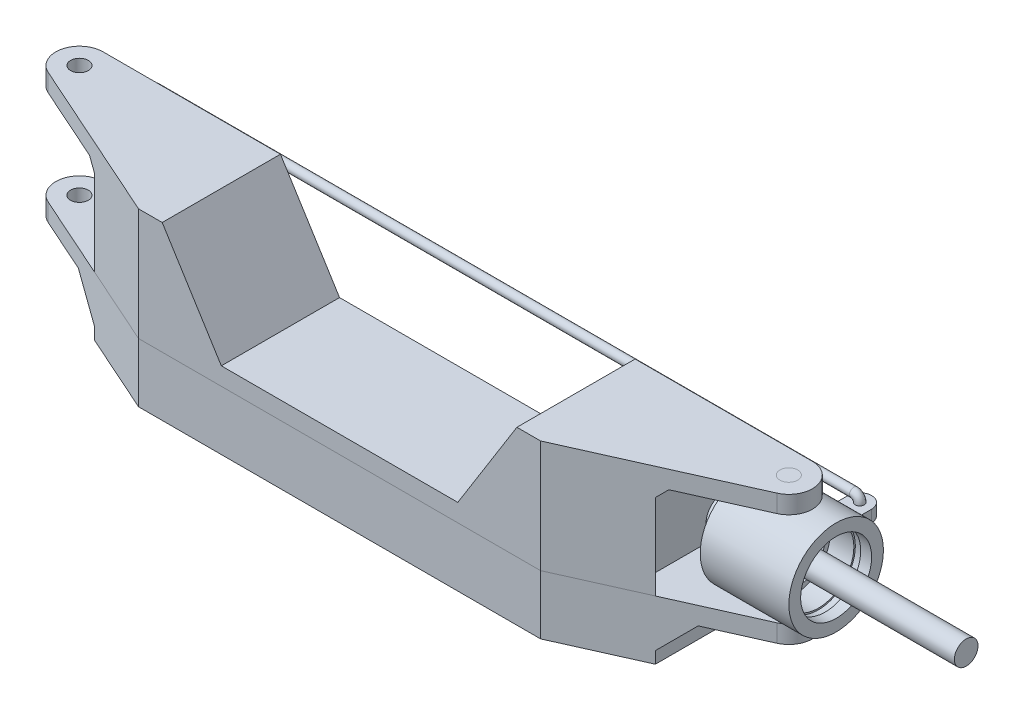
ISO-10303-21;
HEADER;
FILE_DESCRIPTION(('STEP AP214'),'2;1');
FILE_NAME('part.step','',(''),(''),'','','');
FILE_SCHEMA(('AUTOMOTIVE_DESIGN { 1 0 10303 214 1 1 1 1 }'));
ENDSEC;
DATA;
#1=APPLICATION_CONTEXT('core data for automotive mechanical design processes');
#2=APPLICATION_PROTOCOL_DEFINITION('international standard','automotive_design',2000,#1);
#3=PRODUCT_CONTEXT('',#1,'mechanical');
#4=PRODUCT('Part','Part','',(#3));
#5=PRODUCT_RELATED_PRODUCT_CATEGORY('part','',(#4));
#6=PRODUCT_DEFINITION_FORMATION('','',#4);
#7=PRODUCT_DEFINITION_CONTEXT('part definition',#1,'design');
#8=PRODUCT_DEFINITION('design','',#6,#7);
#9=PRODUCT_DEFINITION_SHAPE('','',#8);
#10=(LENGTH_UNIT() NAMED_UNIT(*) SI_UNIT(.MILLI.,.METRE.));
#11=(NAMED_UNIT(*) PLANE_ANGLE_UNIT() SI_UNIT($,.RADIAN.));
#12=(NAMED_UNIT(*) SI_UNIT($,.STERADIAN.) SOLID_ANGLE_UNIT());
#13=UNCERTAINTY_MEASURE_WITH_UNIT(LENGTH_MEASURE(1.E-05),#10,'distance_accuracy_value','');
#14=(GEOMETRIC_REPRESENTATION_CONTEXT(3) GLOBAL_UNCERTAINTY_ASSIGNED_CONTEXT((#13)) GLOBAL_UNIT_ASSIGNED_CONTEXT((#10,
#11,#12)) REPRESENTATION_CONTEXT('',''));
#15=CARTESIAN_POINT('',(0.,0.,0.));
#16=DIRECTION('',(0.,0.,1.));
#17=DIRECTION('',(1.,0.,0.));
#18=AXIS2_PLACEMENT_3D('',#15,#16,#17);
#19=CARTESIAN_POINT('',(49.,0.,0.));
#20=DIRECTION('',(1.,0.,0.));
#21=DIRECTION('',(0.,0.,-1.));
#22=AXIS2_PLACEMENT_3D('',#19,#20,#21);
#23=PLANE('',#22);
#24=CARTESIAN_POINT('',(49.,0.,0.));
#25=DIRECTION('',(1.,0.,0.));
#26=DIRECTION('',(0.,0.,-1.));
#27=AXIS2_PLACEMENT_3D('',#24,#25,#26);
#28=CIRCLE('',#27,3.);
#29=CARTESIAN_POINT('',(49.,0.,-3.));
#30=VERTEX_POINT('',#29);
#31=EDGE_CURVE('E49',#30,#30,#28,.T.);
#32=ORIENTED_EDGE('',*,*,#31,.F.);
#33=EDGE_LOOP('',(#32));
#34=FACE_BOUND('',#33,.T.);
#35=ADVANCED_FACE('F45',(#34),#23,.F.);
#36=CARTESIAN_POINT('',(61.,0.,0.));
#37=DIRECTION('',(-1.,0.,0.));
#38=DIRECTION('',(0.,0.,1.));
#39=AXIS2_PLACEMENT_3D('',#36,#37,#38);
#40=PLANE('',#39);
#41=CARTESIAN_POINT('',(61.,0.,0.));
#42=DIRECTION('',(-1.,0.,0.));
#43=DIRECTION('',(0.,0.,1.));
#44=AXIS2_PLACEMENT_3D('',#41,#42,#43);
#45=CIRCLE('',#44,3.);
#46=CARTESIAN_POINT('',(61.,0.,3.));
#47=VERTEX_POINT('',#46);
#48=EDGE_CURVE('E57',#47,#47,#45,.T.);
#49=ORIENTED_EDGE('',*,*,#48,.F.);
#50=EDGE_LOOP('',(#49));
#51=FACE_BOUND('',#50,.T.);
#52=CARTESIAN_POINT('',(61.,0.,0.));
#53=DIRECTION('',(-1.,0.,0.));
#54=DIRECTION('',(0.,0.,1.));
#55=AXIS2_PLACEMENT_3D('',#52,#53,#54);
#56=CIRCLE('',#55,2.);
#57=CARTESIAN_POINT('',(61.,0.,2.));
#58=VERTEX_POINT('',#57);
#59=EDGE_CURVE('E12',#58,#58,#56,.T.);
#60=ORIENTED_EDGE('',*,*,#59,.T.);
#61=EDGE_LOOP('',(#60));
#62=FACE_BOUND('',#61,.T.);
#63=ADVANCED_FACE('F69',(#51,#62),#40,.F.);
#64=CARTESIAN_POINT('',(69.4852813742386,0.,0.));
#65=DIRECTION('',(-1.,0.,0.));
#66=DIRECTION('',(0.,0.,1.));
#67=AXIS2_PLACEMENT_3D('',#64,#65,#66);
#68=CYLINDRICAL_SURFACE('',#67,3.);
#69=ORIENTED_EDGE('',*,*,#31,.T.);
#70=EDGE_LOOP('',(#69));
#71=FACE_BOUND('',#70,.T.);
#72=ORIENTED_EDGE('',*,*,#48,.T.);
#73=EDGE_LOOP('',(#72));
#74=FACE_BOUND('',#73,.T.);
#75=ADVANCED_FACE('F66',(#71,#74),#68,.T.);
#76=CARTESIAN_POINT('',(90.,0.,0.));
#77=DIRECTION('',(1.,0.,0.));
#78=DIRECTION('',(0.,0.,-1.));
#79=AXIS2_PLACEMENT_3D('',#76,#77,#78);
#80=PLANE('',#79);
#81=CARTESIAN_POINT('',(90.,0.,0.));
#82=DIRECTION('',(1.,0.,0.));
#83=DIRECTION('',(0.,0.,-1.));
#84=AXIS2_PLACEMENT_3D('',#81,#82,#83);
#85=CIRCLE('',#84,2.);
#86=CARTESIAN_POINT('',(90.,0.,2.));
#87=VERTEX_POINT('',#86);
#88=EDGE_CURVE('E53',#87,#87,#85,.T.);
#89=ORIENTED_EDGE('',*,*,#88,.T.);
#90=EDGE_LOOP('',(#89));
#91=FACE_BOUND('',#90,.T.);
#92=ADVANCED_FACE('F78',(#91),#80,.T.);
#93=CARTESIAN_POINT('',(90.,0.,0.));
#94=DIRECTION('',(-1.,0.,0.));
#95=DIRECTION('',(0.,0.,1.));
#96=AXIS2_PLACEMENT_3D('',#93,#94,#95);
#97=CYLINDRICAL_SURFACE('',#96,2.);
#98=CARTESIAN_POINT('',(90.,0.,2.));
#99=CARTESIAN_POINT('',(89.6979166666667,0.,2.));
#100=CARTESIAN_POINT('',(89.3958333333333,0.,2.));
#101=CARTESIAN_POINT('',(88.7916666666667,0.,2.));
#102=CARTESIAN_POINT('',(88.4895833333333,0.,2.));
#103=CARTESIAN_POINT('',(87.8854166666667,0.,2.));
#104=CARTESIAN_POINT('',(87.5833333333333,0.,2.));
#105=CARTESIAN_POINT('',(86.9791666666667,0.,2.));
#106=CARTESIAN_POINT('',(86.6770833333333,0.,2.));
#107=CARTESIAN_POINT('',(86.0729166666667,0.,2.));
#108=CARTESIAN_POINT('',(85.7708333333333,0.,2.));
#109=CARTESIAN_POINT('',(85.1666666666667,0.,2.));
#110=CARTESIAN_POINT('',(84.8645833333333,0.,2.));
#111=CARTESIAN_POINT('',(84.2604166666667,0.,2.));
#112=CARTESIAN_POINT('',(83.9583333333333,0.,2.));
#113=CARTESIAN_POINT('',(83.3541666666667,0.,2.));
#114=CARTESIAN_POINT('',(83.0520833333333,0.,2.));
#115=CARTESIAN_POINT('',(82.4479166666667,0.,2.));
#116=CARTESIAN_POINT('',(82.1458333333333,0.,2.));
#117=CARTESIAN_POINT('',(81.5416666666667,0.,2.));
#118=CARTESIAN_POINT('',(81.2395833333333,0.,2.));
#119=CARTESIAN_POINT('',(80.6354166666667,0.,2.));
#120=CARTESIAN_POINT('',(80.3333333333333,0.,2.));
#121=CARTESIAN_POINT('',(79.7291666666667,0.,2.));
#122=CARTESIAN_POINT('',(79.4270833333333,0.,2.));
#123=CARTESIAN_POINT('',(78.8229166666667,0.,2.));
#124=CARTESIAN_POINT('',(78.5208333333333,0.,2.));
#125=CARTESIAN_POINT('',(77.9166666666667,0.,2.));
#126=CARTESIAN_POINT('',(77.6145833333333,0.,2.));
#127=CARTESIAN_POINT('',(77.0104166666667,0.,2.));
#128=CARTESIAN_POINT('',(76.7083333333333,0.,2.));
#129=CARTESIAN_POINT('',(76.1041666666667,0.,2.));
#130=CARTESIAN_POINT('',(75.8020833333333,0.,2.));
#131=CARTESIAN_POINT('',(75.1979166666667,0.,2.));
#132=CARTESIAN_POINT('',(74.8958333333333,0.,2.));
#133=CARTESIAN_POINT('',(74.2916666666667,0.,2.));
#134=CARTESIAN_POINT('',(73.9895833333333,0.,2.));
#135=CARTESIAN_POINT('',(73.3854166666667,0.,2.));
#136=CARTESIAN_POINT('',(73.0833333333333,0.,2.));
#137=CARTESIAN_POINT('',(72.4791666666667,0.,2.));
#138=CARTESIAN_POINT('',(72.1770833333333,0.,2.));
#139=CARTESIAN_POINT('',(71.5729166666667,0.,2.));
#140=CARTESIAN_POINT('',(71.2708333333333,0.,2.));
#141=CARTESIAN_POINT('',(70.6666666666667,0.,2.));
#142=CARTESIAN_POINT('',(70.3645833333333,0.,2.));
#143=CARTESIAN_POINT('',(69.7604166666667,0.,2.));
#144=CARTESIAN_POINT('',(69.4583333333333,0.,2.));
#145=CARTESIAN_POINT('',(68.8541666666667,0.,2.));
#146=CARTESIAN_POINT('',(68.5520833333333,0.,2.));
#147=CARTESIAN_POINT('',(67.9479166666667,0.,2.));
#148=CARTESIAN_POINT('',(67.6458333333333,0.,2.));
#149=CARTESIAN_POINT('',(67.0416666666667,0.,2.));
#150=CARTESIAN_POINT('',(66.7395833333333,0.,2.));
#151=CARTESIAN_POINT('',(66.1354166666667,0.,2.));
#152=CARTESIAN_POINT('',(65.8333333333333,0.,2.));
#153=CARTESIAN_POINT('',(65.2291666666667,0.,2.));
#154=CARTESIAN_POINT('',(64.9270833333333,0.,2.));
#155=CARTESIAN_POINT('',(64.3229166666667,0.,2.));
#156=CARTESIAN_POINT('',(64.0208333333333,0.,2.));
#157=CARTESIAN_POINT('',(63.4166666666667,0.,2.));
#158=CARTESIAN_POINT('',(63.1145833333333,0.,2.));
#159=CARTESIAN_POINT('',(62.5104166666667,0.,2.));
#160=CARTESIAN_POINT('',(62.2083333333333,0.,2.));
#161=CARTESIAN_POINT('',(61.6041666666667,0.,2.));
#162=CARTESIAN_POINT('',(61.3020833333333,0.,2.));
#163=CARTESIAN_POINT('',(61.,0.,2.));
#164=B_SPLINE_CURVE_WITH_KNOTS('',3,(#98,#99,#100,#101,#102,#103,#104,#105,#106,#107,#108,#109,
#110,#111,#112,#113,#114,#115,#116,#117,#118,#119,#120,#121,#122,#123,#124,#125,#126,#127,#128,
#129,#130,#131,#132,#133,#134,#135,#136,#137,#138,#139,#140,#141,#142,#143,#144,#145,#146,#147,
#148,#149,#150,#151,#152,#153,#154,#155,#156,#157,#158,#159,#160,#161,#162,#163),.UNSPECIFIED.,
.F.,.F.,(4,2,2,2,2,2,2,2,2,2,2,2,2,2,2,2,2,2,2,2,2,2,2,2,2,2,2,2,2,2,2,2,4),(0.,
0.906249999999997,1.81249999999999,2.71874999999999,3.62499999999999,4.53124999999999,
5.43749999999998,6.34375,7.24999999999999,8.15624999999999,9.06249999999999,9.96874999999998,
10.875,11.78125,12.6875,13.59375,14.5,15.40625,16.3125,17.21875,18.125,19.03125,19.9375,
20.84375,21.75,22.65625,23.5625,24.46875,25.375,26.28125,27.1875,28.09375,29.),.UNSPECIFIED.);
#165=EDGE_CURVE('BSEAM47',#87,#58,#164,.T.);
#166=ORIENTED_EDGE('',*,*,#88,.F.);
#167=ORIENTED_EDGE('',*,*,#59,.F.);
#168=ORIENTED_EDGE('',*,*,#165,.T.);
#169=ORIENTED_EDGE('',*,*,#165,.F.);
#170=EDGE_LOOP('',(#166,#168,#167,#169));
#171=FACE_BOUND('',#170,.T.);
#172=ADVANCED_FACE('F47',(#171),#97,.T.);
#173=CLOSED_SHELL('',(#35,#63,#75,#92,#172));
#174=MANIFOLD_SOLID_BREP('B2',#173);
#175=CARTESIAN_POINT('',(53.,0.,0.));
#176=DIRECTION('',(1.,0.,0.));
#177=DIRECTION('',(0.,0.,-1.));
#178=AXIS2_PLACEMENT_3D('',#175,#176,#177);
#179=CYLINDRICAL_SURFACE('',#178,8.);
#180=CARTESIAN_POINT('',(68.,0.,0.));
#181=DIRECTION('',(1.,0.,0.));
#182=DIRECTION('',(0.,0.,-1.));
#183=AXIS2_PLACEMENT_3D('',#180,#181,#182);
#184=CIRCLE('',#183,8.);
#185=CARTESIAN_POINT('',(68.,0.,-8.));
#186=VERTEX_POINT('',#185);
#187=EDGE_CURVE('E217',#186,#186,#184,.T.);
#188=ORIENTED_EDGE('',*,*,#187,.F.);
#189=EDGE_LOOP('',(#188));
#190=FACE_BOUND('',#189,.T.);
#191=CARTESIAN_POINT('',(53.,0.,0.));
#192=DIRECTION('',(1.,0.,0.));
#193=DIRECTION('',(0.,0.,-1.));
#194=AXIS2_PLACEMENT_3D('',#191,#192,#193);
#195=CIRCLE('',#194,8.);
#196=CARTESIAN_POINT('',(53.,0.,-8.));
#197=VERTEX_POINT('',#196);
#198=EDGE_CURVE('E223',#197,#197,#195,.T.);
#199=ORIENTED_EDGE('',*,*,#198,.T.);
#200=EDGE_LOOP('',(#199));
#201=FACE_BOUND('',#200,.T.);
#202=CARTESIAN_POINT('',(60.,7.85811682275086,1.49999999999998));
#203=CARTESIAN_POINT('',(60.0834572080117,7.85811843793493,1.49999679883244));
#204=CARTESIAN_POINT('',(60.1669559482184,7.85946079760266,1.49301126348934));
#205=CARTESIAN_POINT('',(60.3315989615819,7.86467851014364,1.46527253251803));
#206=CARTESIAN_POINT('',(60.4127411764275,7.86855601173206,1.44450765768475));
#207=CARTESIAN_POINT('',(60.5702650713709,7.87838976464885,1.38987035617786));
#208=CARTESIAN_POINT('',(60.6466511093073,7.88434407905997,1.35601013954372));
#209=CARTESIAN_POINT('',(60.7926535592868,7.89765826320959,1.27617565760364));
#210=CARTESIAN_POINT('',(60.8622704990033,7.90501802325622,1.23020233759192));
#211=CARTESIAN_POINT('',(60.9936301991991,7.92041614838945,1.12683678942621));
#212=CARTESIAN_POINT('',(61.0552764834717,7.92846116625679,1.0693229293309));
#213=CARTESIAN_POINT('',(61.1681043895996,7.94426457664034,0.944771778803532));
#214=CARTESIAN_POINT('',(61.2192853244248,7.95202295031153,0.877733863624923));
#215=CARTESIAN_POINT('',(61.3100993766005,7.96645017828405,0.735403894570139));
#216=CARTESIAN_POINT('',(61.3496415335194,7.97311028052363,0.660052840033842));
#217=CARTESIAN_POINT('',(61.4154695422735,7.98451608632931,0.50363128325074));
#218=CARTESIAN_POINT('',(61.4417564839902,7.98926194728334,0.422561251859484));
#219=CARTESIAN_POINT('',(61.4800295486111,7.99625755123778,0.258002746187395));
#220=CARTESIAN_POINT('',(61.4921783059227,7.99853565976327,0.174553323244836));
#221=CARTESIAN_POINT('',(61.5023368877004,8.00043684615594,0.00677167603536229));
#222=CARTESIAN_POINT('',(61.5003479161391,8.00006015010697,-0.0775604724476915));
#223=CARTESIAN_POINT('',(61.4824122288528,7.99671633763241,-0.243598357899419));
#224=CARTESIAN_POINT('',(61.46664063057,7.99378172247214,-0.325323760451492));
#225=CARTESIAN_POINT('',(61.4218643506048,7.98568826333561,-0.484947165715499));
#226=CARTESIAN_POINT('',(61.3928591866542,7.98052933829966,-0.562845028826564));
#227=CARTESIAN_POINT('',(61.3222722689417,7.96851260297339,-0.713110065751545));
#228=CARTESIAN_POINT('',(61.2806205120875,7.96164537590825,-0.785443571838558));
#229=CARTESIAN_POINT('',(61.1859743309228,7.9469714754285,-0.922159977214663));
#230=CARTESIAN_POINT('',(61.1329787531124,7.93916470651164,-0.986542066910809));
#231=CARTESIAN_POINT('',(61.0161842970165,7.92333513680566,-1.10656561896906));
#232=CARTESIAN_POINT('',(60.9522322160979,7.91531085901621,-1.16205790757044));
#233=CARTESIAN_POINT('',(60.8158504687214,7.9000650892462,-1.26155171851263));
#234=CARTESIAN_POINT('',(60.7434206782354,7.8928436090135,-1.30555307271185));
#235=CARTESIAN_POINT('',(60.5919417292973,7.88001893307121,-1.3808585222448));
#236=CARTESIAN_POINT('',(60.5128815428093,7.8744185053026,-1.41214093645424));
#237=CARTESIAN_POINT('',(60.3504988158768,7.86551242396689,-1.46093656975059));
#238=CARTESIAN_POINT('',(60.2671767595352,7.86220651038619,-1.47845134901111));
#239=CARTESIAN_POINT('',(60.0999806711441,7.85831520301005,-1.49899672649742));
#240=CARTESIAN_POINT('',(60.0161338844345,7.85768955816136,-1.50224164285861));
#241=CARTESIAN_POINT('',(59.8490965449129,7.8591219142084,-1.49472968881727));
#242=CARTESIAN_POINT('',(59.7659059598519,7.86117978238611,-1.48397351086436));
#243=CARTESIAN_POINT('',(59.6032470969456,7.86770980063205,-1.44894868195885));
#244=CARTESIAN_POINT('',(59.5237537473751,7.87216186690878,-1.42479238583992));
#245=CARTESIAN_POINT('',(59.3699428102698,7.88296134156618,-1.36377224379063));
#246=CARTESIAN_POINT('',(59.2956256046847,7.88930888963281,-1.32690746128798));
#247=CARTESIAN_POINT('',(59.1533323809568,7.90327577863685,-1.24102353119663));
#248=CARTESIAN_POINT('',(59.0854394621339,7.91090895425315,-1.19186899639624));
#249=CARTESIAN_POINT('',(58.9587879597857,7.926548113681,-1.08298344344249));
#250=CARTESIAN_POINT('',(58.9000301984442,7.93455413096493,-1.02325147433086));
#251=CARTESIAN_POINT('',(58.7925162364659,7.95016624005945,-0.893949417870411));
#252=CARTESIAN_POINT('',(58.743904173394,7.95776555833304,-0.824258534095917));
#253=CARTESIAN_POINT('',(58.6590787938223,7.9715940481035,-0.677574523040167));
#254=CARTESIAN_POINT('',(58.622864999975,7.97782327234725,-0.600581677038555));
#255=CARTESIAN_POINT('',(58.5640799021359,7.98818057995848,-0.441877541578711));
#256=CARTESIAN_POINT('',(58.5414378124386,7.99231954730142,-0.360193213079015));
#257=CARTESIAN_POINT('',(58.5102129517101,7.99807642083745,-0.194096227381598));
#258=CARTESIAN_POINT('',(58.5016287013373,7.99969459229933,-0.109683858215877));
#259=CARTESIAN_POINT('',(58.4988146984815,8.00022227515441,0.058090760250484));
#260=CARTESIAN_POINT('',(58.5043672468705,7.99917286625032,0.141449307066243));
#261=CARTESIAN_POINT('',(58.5291924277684,7.99456866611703,0.306023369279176));
#262=CARTESIAN_POINT('',(58.5484649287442,7.99101389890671,0.387238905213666));
#263=CARTESIAN_POINT('',(58.6000912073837,7.98179837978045,0.545106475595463));
#264=CARTESIAN_POINT('',(58.632421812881,7.97614135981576,0.621766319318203));
#265=CARTESIAN_POINT('',(58.7092204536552,7.96333372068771,0.768605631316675));
#266=CARTESIAN_POINT('',(58.7536893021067,7.95618300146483,0.838784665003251));
#267=CARTESIAN_POINT('',(58.8542514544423,7.94104779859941,0.971755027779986));
#268=CARTESIAN_POINT('',(58.9105020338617,7.93305284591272,1.03442623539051));
#269=CARTESIAN_POINT('',(59.0327045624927,7.91719633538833,1.14951536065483));
#270=CARTESIAN_POINT('',(59.0986587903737,7.90933480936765,1.20193086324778));
#271=CARTESIAN_POINT('',(59.2391264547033,7.89455577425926,1.29547633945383));
#272=CARTESIAN_POINT('',(59.3137134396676,7.88764767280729,1.3364974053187));
#273=CARTESIAN_POINT('',(59.4688257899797,7.87567084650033,1.40536132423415));
#274=CARTESIAN_POINT('',(59.5493454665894,7.87060038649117,1.4332166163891));
#275=CARTESIAN_POINT('',(59.6917522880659,7.86393016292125,1.46929726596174));
#276=CARTESIAN_POINT('',(59.7528057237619,7.86176310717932,1.48079105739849));
#277=CARTESIAN_POINT('',(59.8758984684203,7.85885585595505,1.49614351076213));
#278=CARTESIAN_POINT('',(59.9379377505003,7.85811562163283,1.50000238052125));
#279=CARTESIAN_POINT('',(60.,7.85811682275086,1.49999999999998));
#280=B_SPLINE_CURVE_WITH_KNOTS('',3,(#202,#203,#204,#205,#206,#207,#208,#209,#210,#211,#212,
#213,#214,#215,#216,#217,#218,#219,#220,#221,#222,#223,#224,#225,#226,#227,#228,#229,#230,#231,
#232,#233,#234,#235,#236,#237,#238,#239,#240,#241,#242,#243,#244,#245,#246,#247,#248,#249,#250,
#251,#252,#253,#254,#255,#256,#257,#258,#259,#260,#261,#262,#263,#264,#265,#266,#267,#268,#269,
#270,#271,#272,#273,#274,#275,#276,#277,#278,#279),.UNSPECIFIED.,.T.,.F.,(4,2,2,2,2,2,2,2,2,2,2,
2,2,2,2,2,2,2,2,2,2,2,2,2,2,2,2,2,2,2,2,2,2,2,2,2,2,2,4),(0.,0.250144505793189,
0.500501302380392,0.750625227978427,1.00072963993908,1.25362335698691,1.50653367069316,
1.76137104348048,2.01618745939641,2.26804275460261,2.51987660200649,2.76855650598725,
3.01724547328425,3.2673369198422,3.51745380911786,3.77140614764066,4.02536220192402,
4.27974936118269,4.53410768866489,4.78463248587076,5.03514489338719,5.28358792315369,
5.53204926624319,5.78337862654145,6.03473059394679,6.28944125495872,6.54414210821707,
6.79750269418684,7.05083661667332,7.3002930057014,7.54974700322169,7.7987602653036,
8.04779021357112,8.30038464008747,8.55303847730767,8.8080300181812,9.06278015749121,
9.24880307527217,9.43482092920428),.UNSPECIFIED.);
#281=CARTESIAN_POINT('',(60.,7.85811682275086,1.49999999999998));
#282=VERTEX_POINT('',#281);
#283=EDGE_CURVE('E226',#282,#282,#280,.T.);
#284=ORIENTED_EDGE('',*,*,#283,.F.);
#285=EDGE_LOOP('',(#284));
#286=FACE_BOUND('',#285,.T.);
#287=CARTESIAN_POINT('',(61.5,-8.,0.));
#288=CARTESIAN_POINT('',(61.4999968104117,-7.99999848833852,0.0834717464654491));
#289=CARTESIAN_POINT('',(61.4930089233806,-7.99868009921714,0.166984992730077));
#290=CARTESIAN_POINT('',(61.4652600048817,-7.9935478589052,0.331658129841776));
#291=CARTESIAN_POINT('',(61.4444873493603,-7.98973190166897,0.412815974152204));
#292=CARTESIAN_POINT('',(61.3898272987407,-7.98003138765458,0.570372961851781));
#293=CARTESIAN_POINT('',(61.3559517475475,-7.97414869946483,0.646776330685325));
#294=CARTESIAN_POINT('',(61.2760811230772,-7.96095710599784,0.792807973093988));
#295=CARTESIAN_POINT('',(61.2300870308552,-7.9536483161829,0.862436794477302));
#296=CARTESIAN_POINT('',(61.1267002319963,-7.93831336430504,0.993783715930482));
#297=CARTESIAN_POINT('',(61.0691905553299,-7.93028034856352,1.05540895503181));
#298=CARTESIAN_POINT('',(60.9446566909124,-7.91445318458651,1.16819606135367));
#299=CARTESIAN_POINT('',(60.8776318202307,-7.90665905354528,1.21935717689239));
#300=CARTESIAN_POINT('',(60.735313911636,-7.89212551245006,1.31014998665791));
#301=CARTESIAN_POINT('',(60.6599596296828,-7.88539493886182,1.34968721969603));
#302=CARTESIAN_POINT('',(60.5035310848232,-7.87384713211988,1.41550524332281));
#303=CARTESIAN_POINT('',(60.4224573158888,-7.86902973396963,1.44178717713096));
#304=CARTESIAN_POINT('',(60.2578847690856,-7.8619226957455,1.48005053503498));
#305=CARTESIAN_POINT('',(60.1744249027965,-7.85960445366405,1.49219390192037));
#306=CARTESIAN_POINT('',(60.0066226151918,-7.85767197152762,1.50233808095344));
#307=CARTESIAN_POINT('',(59.9222802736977,-7.8580574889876,1.50034016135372));
#308=CARTESIAN_POINT('',(59.756280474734,-7.86146292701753,1.48238979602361));
#309=CARTESIAN_POINT('',(59.6746022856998,-7.86444808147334,1.46662149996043));
#310=CARTESIAN_POINT('',(59.5150715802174,-7.87266183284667,1.42186799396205));
#311=CARTESIAN_POINT('',(59.4372192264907,-7.87789052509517,1.39288222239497));
#312=CARTESIAN_POINT('',(59.2870113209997,-7.89003855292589,1.32233647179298));
#313=CARTESIAN_POINT('',(59.2146915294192,-7.89696783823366,1.28070213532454));
#314=CARTESIAN_POINT('',(59.0779952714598,-7.91172971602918,1.18609368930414));
#315=CARTESIAN_POINT('',(59.0136196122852,-7.91956240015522,1.13311842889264));
#316=CARTESIAN_POINT('',(58.8935750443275,-7.93540001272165,1.01633905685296));
#317=CARTESIAN_POINT('',(58.8380593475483,-7.94340571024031,0.952377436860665));
#318=CARTESIAN_POINT('',(58.7385227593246,-7.95857386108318,0.815968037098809));
#319=CARTESIAN_POINT('',(58.6945019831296,-7.96573630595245,0.743520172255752));
#320=CARTESIAN_POINT('',(58.61918224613,-7.97842539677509,0.59203498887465));
#321=CARTESIAN_POINT('',(58.5878992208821,-7.98394999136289,0.512989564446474));
#322=CARTESIAN_POINT('',(58.5390979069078,-7.99272505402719,0.350639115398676));
#323=CARTESIAN_POINT('',(58.5215781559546,-7.99597576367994,0.267334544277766));
#324=CARTESIAN_POINT('',(58.5010139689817,-7.99980360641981,0.100148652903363));
#325=CARTESIAN_POINT('',(58.4977596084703,-8.00041950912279,0.0162940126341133));
#326=CARTESIAN_POINT('',(58.5052554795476,-7.99901543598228,-0.150761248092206));
#327=CARTESIAN_POINT('',(58.5160050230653,-7.99699558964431,-0.233961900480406));
#328=CARTESIAN_POINT('',(58.5510290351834,-7.99057111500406,-0.396681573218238));
#329=CARTESIAN_POINT('',(58.5751972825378,-7.98618522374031,-0.476224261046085));
#330=CARTESIAN_POINT('',(58.6362577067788,-7.97551842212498,-0.630128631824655));
#331=CARTESIAN_POINT('',(58.6731507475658,-7.96923738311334,-0.704489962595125));
#332=CARTESIAN_POINT('',(58.7590781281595,-7.95538030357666,-0.846816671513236));
#333=CARTESIAN_POINT('',(58.8082407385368,-7.94779086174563,-0.914703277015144));
#334=CARTESIAN_POINT('',(58.9171381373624,-7.93219343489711,-1.04133832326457));
#335=CARTESIAN_POINT('',(58.9768739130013,-7.92418541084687,-1.10008590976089));
#336=CARTESIAN_POINT('',(59.1061723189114,-7.9085247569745,-1.2075729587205));
#337=CARTESIAN_POINT('',(59.1758549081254,-7.90087825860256,-1.25616916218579));
#338=CARTESIAN_POINT('',(59.3225176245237,-7.88692985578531,-1.34096675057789));
#339=CARTESIAN_POINT('',(59.3994974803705,-7.88062790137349,-1.37716859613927));
#340=CARTESIAN_POINT('',(59.5582058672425,-7.87013024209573,-1.43594673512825));
#341=CARTESIAN_POINT('',(59.6399093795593,-7.86592440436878,-1.45858868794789));
#342=CARTESIAN_POINT('',(59.8060472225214,-7.86007203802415,-1.48980679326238));
#343=CARTESIAN_POINT('',(59.8904812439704,-7.85842522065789,-1.49838453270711));
#344=CARTESIAN_POINT('',(60.0582483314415,-7.85789199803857,-1.50117762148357));
#345=CARTESIAN_POINT('',(60.141577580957,-7.85896215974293,-1.49561895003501));
#346=CARTESIAN_POINT('',(60.3060914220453,-7.86364600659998,-1.47079175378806));
#347=CARTESIAN_POINT('',(60.3872760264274,-7.86725967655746,-1.45152331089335));
#348=CARTESIAN_POINT('',(60.5450744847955,-7.87660508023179,-1.39991887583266));
#349=CARTESIAN_POINT('',(60.6216965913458,-7.88233284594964,-1.36760735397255));
#350=CARTESIAN_POINT('',(60.7684682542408,-7.8952638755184,-1.29085868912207));
#351=CARTESIAN_POINT('',(60.8386173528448,-7.90246724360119,-1.24642068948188));
#352=CARTESIAN_POINT('',(60.9715836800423,-7.91767266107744,-1.14589487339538));
#353=CARTESIAN_POINT('',(61.0342754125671,-7.92568505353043,-1.08964259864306));
#354=CARTESIAN_POINT('',(61.1494051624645,-7.94152833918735,-0.967427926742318));
#355=CARTESIAN_POINT('',(61.2018408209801,-7.94935919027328,-0.901463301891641));
#356=CARTESIAN_POINT('',(61.2954109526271,-7.96403975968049,-0.760984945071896));
#357=CARTESIAN_POINT('',(61.3364394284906,-7.97088000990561,-0.686399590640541));
#358=CARTESIAN_POINT('',(61.4053176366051,-7.98271619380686,-0.531290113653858));
#359=CARTESIAN_POINT('',(61.4331797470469,-7.98771385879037,-0.450771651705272));
#360=CARTESIAN_POINT('',(61.4692773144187,-7.99428290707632,-0.308347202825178));
#361=CARTESIAN_POINT('',(61.4807786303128,-7.99641470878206,-0.247273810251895));
#362=CARTESIAN_POINT('',(61.4961410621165,-7.9992737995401,-0.124141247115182));
#363=CARTESIAN_POINT('',(61.5000023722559,-8.00000112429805,-0.0620821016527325));
#364=CARTESIAN_POINT('',(61.5,-8.,0.));
#365=B_SPLINE_CURVE_WITH_KNOTS('',3,(#287,#288,#289,#290,#291,#292,#293,#294,#295,#296,#297,
#298,#299,#300,#301,#302,#303,#304,#305,#306,#307,#308,#309,#310,#311,#312,#313,#314,#315,#316,
#317,#318,#319,#320,#321,#322,#323,#324,#325,#326,#327,#328,#329,#330,#331,#332,#333,#334,#335,
#336,#337,#338,#339,#340,#341,#342,#343,#344,#345,#346,#347,#348,#349,#350,#351,#352,#353,#354,
#355,#356,#357,#358,#359,#360,#361,#362,#363,#364),.UNSPECIFIED.,.T.,.F.,(4,2,2,2,2,2,2,2,2,2,2,
2,2,2,2,2,2,2,2,2,2,2,2,2,2,2,2,2,2,2,2,2,2,2,2,2,2,2,4),(0.,0.250188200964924,
0.500587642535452,0.75076127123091,1.00091465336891,1.2537511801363,1.50660586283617,
1.76146190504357,2.01629596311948,2.26818151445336,2.52004447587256,2.76859000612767,
3.01714609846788,3.26719262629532,3.5172645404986,3.77127768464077,4.02529337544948,
4.27962588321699,4.53393136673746,4.78448174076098,5.03501980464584,5.28360233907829,
5.53220175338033,5.7835177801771,6.03485728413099,6.28953436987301,6.54420198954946,
6.7976262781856,7.05102196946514,7.30039252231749,7.54976158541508,7.79866496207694,
8.04758592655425,8.30023369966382,8.55293951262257,8.80792048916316,9.06266126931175,
9.24874344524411,9.43482089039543),.UNSPECIFIED.);
#366=CARTESIAN_POINT('',(61.5,-8.,0.));
#367=VERTEX_POINT('',#366);
#368=EDGE_CURVE('E236',#367,#367,#365,.T.);
#369=ORIENTED_EDGE('',*,*,#368,.F.);
#370=EDGE_LOOP('',(#369));
#371=FACE_BOUND('',#370,.T.);
#372=DIRECTION('',(1.,0.,0.));
#373=VECTOR('',#372,1.);
#374=CARTESIAN_POINT('',(53.,-1.,-7.93725393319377));
#375=LINE('',#374,#373);
#376=CARTESIAN_POINT('',(62.,-1.,-7.93725393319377));
#377=VERTEX_POINT('',#376);
#378=CARTESIAN_POINT('',(58.,-1.,-7.93725393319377));
#379=VERTEX_POINT('',#378);
#380=EDGE_CURVE('E134',#377,#379,#375,.F.);
#381=ORIENTED_EDGE('',*,*,#380,.F.);
#382=CARTESIAN_POINT('',(62.,0.,0.));
#383=DIRECTION('',(-1.,0.,0.));
#384=DIRECTION('',(0.,0.,1.));
#385=AXIS2_PLACEMENT_3D('',#382,#383,#384);
#386=CIRCLE('',#385,8.);
#387=CARTESIAN_POINT('',(62.,1.,-7.93725393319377));
#388=VERTEX_POINT('',#387);
#389=EDGE_CURVE('E188',#377,#388,#386,.F.);
#390=ORIENTED_EDGE('',*,*,#389,.T.);
#391=DIRECTION('',(1.,0.,0.));
#392=VECTOR('',#391,1.);
#393=CARTESIAN_POINT('',(53.,1.,-7.93725393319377));
#394=LINE('',#393,#392);
#395=CARTESIAN_POINT('',(58.,1.,-7.93725393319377));
#396=VERTEX_POINT('',#395);
#397=EDGE_CURVE('E43',#388,#396,#394,.F.);
#398=ORIENTED_EDGE('',*,*,#397,.T.);
#399=CARTESIAN_POINT('',(58.,0.,0.));
#400=DIRECTION('',(1.,0.,0.));
#401=DIRECTION('',(0.,0.,-1.));
#402=AXIS2_PLACEMENT_3D('',#399,#400,#401);
#403=CIRCLE('',#402,8.);
#404=EDGE_CURVE('E146',#396,#379,#403,.F.);
#405=ORIENTED_EDGE('',*,*,#404,.T.);
#406=EDGE_LOOP('',(#381,#390,#398,#405));
#407=FACE_BOUND('',#406,.T.);
#408=ADVANCED_FACE('F126',(#190,#201,#286,#371,#407),#179,.T.);
#409=CARTESIAN_POINT('',(61.,0.,0.));
#410=DIRECTION('',(1.,0.,0.));
#411=DIRECTION('',(0.,0.,-1.));
#412=AXIS2_PLACEMENT_3D('',#409,#410,#411);
#413=CYLINDRICAL_SURFACE('',#412,6.);
#414=CARTESIAN_POINT('',(66.15,0.,0.));
#415=DIRECTION('',(1.,0.,0.));
#416=DIRECTION('',(0.,0.,-1.));
#417=AXIS2_PLACEMENT_3D('',#414,#415,#416);
#418=CIRCLE('',#417,6.);
#419=CARTESIAN_POINT('',(66.15,0.,-6.));
#420=VERTEX_POINT('',#419);
#421=EDGE_CURVE('E213',#420,#420,#418,.T.);
#422=ORIENTED_EDGE('',*,*,#421,.F.);
#423=EDGE_LOOP('',(#422));
#424=FACE_BOUND('',#423,.T.);
#425=CARTESIAN_POINT('',(68.,0.,0.));
#426=DIRECTION('',(1.,0.,0.));
#427=DIRECTION('',(0.,0.,-1.));
#428=AXIS2_PLACEMENT_3D('',#425,#426,#427);
#429=CIRCLE('',#428,6.);
#430=CARTESIAN_POINT('',(68.,0.,-6.));
#431=VERTEX_POINT('',#430);
#432=EDGE_CURVE('E214',#431,#431,#429,.T.);
#433=ORIENTED_EDGE('',*,*,#432,.T.);
#434=EDGE_LOOP('',(#433));
#435=FACE_BOUND('',#434,.T.);
#436=ADVANCED_FACE('F271',(#424,#435),#413,.F.);
#437=CARTESIAN_POINT('',(68.,0.,0.));
#438=DIRECTION('',(1.,0.,0.));
#439=DIRECTION('',(0.,0.,-1.));
#440=AXIS2_PLACEMENT_3D('',#437,#438,#439);
#441=PLANE('',#440);
#442=ORIENTED_EDGE('',*,*,#187,.T.);
#443=EDGE_LOOP('',(#442));
#444=FACE_BOUND('',#443,.T.);
#445=ORIENTED_EDGE('',*,*,#432,.F.);
#446=EDGE_LOOP('',(#445));
#447=FACE_BOUND('',#446,.T.);
#448=ADVANCED_FACE('F268',(#444,#447),#441,.T.);
#449=CARTESIAN_POINT('',(53.,0.,0.));
#450=DIRECTION('',(1.,0.,0.));
#451=DIRECTION('',(0.,0.,-1.));
#452=AXIS2_PLACEMENT_3D('',#449,#450,#451);
#453=PLANE('',#452);
#454=CARTESIAN_POINT('',(53.,0.,0.));
#455=DIRECTION('',(1.,0.,0.));
#456=DIRECTION('',(0.,0.,-1.));
#457=AXIS2_PLACEMENT_3D('',#454,#455,#456);
#458=CIRCLE('',#457,5.2);
#459=CARTESIAN_POINT('',(53.,0.,-5.2));
#460=VERTEX_POINT('',#459);
#461=EDGE_CURVE('E201',#460,#460,#458,.T.);
#462=ORIENTED_EDGE('',*,*,#461,.T.);
#463=EDGE_LOOP('',(#462));
#464=FACE_BOUND('',#463,.T.);
#465=ORIENTED_EDGE('',*,*,#198,.F.);
#466=EDGE_LOOP('',(#465));
#467=FACE_BOUND('',#466,.T.);
#468=ADVANCED_FACE('F266',(#464,#467),#453,.F.);
#469=CARTESIAN_POINT('',(66.15,0.,0.));
#470=DIRECTION('',(-1.,0.,0.));
#471=DIRECTION('',(0.,0.,1.));
#472=AXIS2_PLACEMENT_3D('',#469,#470,#471);
#473=CYLINDRICAL_SURFACE('',#472,6.25);
#474=CARTESIAN_POINT('',(66.15,0.,0.));
#475=DIRECTION('',(1.,0.,0.));
#476=DIRECTION('',(0.,0.,-1.));
#477=AXIS2_PLACEMENT_3D('',#474,#475,#476);
#478=CIRCLE('',#477,6.25);
#479=CARTESIAN_POINT('',(66.15,0.,-6.25));
#480=VERTEX_POINT('',#479);
#481=EDGE_CURVE('E205',#480,#480,#478,.T.);
#482=ORIENTED_EDGE('',*,*,#481,.T.);
#483=EDGE_LOOP('',(#482));
#484=FACE_BOUND('',#483,.T.);
#485=CARTESIAN_POINT('',(65.,0.,0.));
#486=DIRECTION('',(1.,0.,0.));
#487=DIRECTION('',(0.,0.,-1.));
#488=AXIS2_PLACEMENT_3D('',#485,#486,#487);
#489=CIRCLE('',#488,6.25);
#490=CARTESIAN_POINT('',(65.,0.,-6.25));
#491=VERTEX_POINT('',#490);
#492=EDGE_CURVE('E204',#491,#491,#489,.T.);
#493=ORIENTED_EDGE('',*,*,#492,.F.);
#494=EDGE_LOOP('',(#493));
#495=FACE_BOUND('',#494,.T.);
#496=ADVANCED_FACE('F258',(#484,#495),#473,.F.);
#497=CARTESIAN_POINT('',(66.15,0.,0.));
#498=DIRECTION('',(1.,0.,0.));
#499=DIRECTION('',(0.,0.,-1.));
#500=AXIS2_PLACEMENT_3D('',#497,#498,#499);
#501=PLANE('',#500);
#502=ORIENTED_EDGE('',*,*,#421,.T.);
#503=EDGE_LOOP('',(#502));
#504=FACE_BOUND('',#503,.T.);
#505=ORIENTED_EDGE('',*,*,#481,.F.);
#506=EDGE_LOOP('',(#505));
#507=FACE_BOUND('',#506,.T.);
#508=ADVANCED_FACE('F254',(#504,#507),#501,.F.);
#509=CARTESIAN_POINT('',(65.,0.,0.));
#510=DIRECTION('',(1.,0.,0.));
#511=DIRECTION('',(0.,0.,-1.));
#512=AXIS2_PLACEMENT_3D('',#509,#510,#511);
#513=PLANE('',#512);
#514=CARTESIAN_POINT('',(65.,0.,0.));
#515=DIRECTION('',(1.,0.,0.));
#516=DIRECTION('',(0.,0.,-1.));
#517=AXIS2_PLACEMENT_3D('',#514,#515,#516);
#518=CIRCLE('',#517,6.);
#519=CARTESIAN_POINT('',(65.,0.,-6.));
#520=VERTEX_POINT('',#519);
#521=EDGE_CURVE('E208',#520,#520,#518,.T.);
#522=ORIENTED_EDGE('',*,*,#521,.F.);
#523=EDGE_LOOP('',(#522));
#524=FACE_BOUND('',#523,.T.);
#525=ORIENTED_EDGE('',*,*,#492,.T.);
#526=EDGE_LOOP('',(#525));
#527=FACE_BOUND('',#526,.T.);
#528=ADVANCED_FACE('F257',(#524,#527),#513,.T.);
#529=CARTESIAN_POINT('',(61.,0.,0.));
#530=DIRECTION('',(-1.,0.,0.));
#531=DIRECTION('',(0.,0.,1.));
#532=AXIS2_PLACEMENT_3D('',#529,#530,#531);
#533=PLANE('',#532);
#534=CARTESIAN_POINT('',(61.,0.,0.));
#535=DIRECTION('',(-1.,0.,0.));
#536=DIRECTION('',(0.,0.,1.));
#537=AXIS2_PLACEMENT_3D('',#534,#535,#536);
#538=CIRCLE('',#537,5.2);
#539=CARTESIAN_POINT('',(61.,0.,5.2));
#540=VERTEX_POINT('',#539);
#541=EDGE_CURVE('E200',#540,#540,#538,.T.);
#542=ORIENTED_EDGE('',*,*,#541,.T.);
#543=EDGE_LOOP('',(#542));
#544=FACE_BOUND('',#543,.T.);
#545=CARTESIAN_POINT('',(61.,0.,0.));
#546=DIRECTION('',(-1.,0.,0.));
#547=DIRECTION('',(0.,0.,1.));
#548=AXIS2_PLACEMENT_3D('',#545,#546,#547);
#549=CIRCLE('',#548,6.);
#550=CARTESIAN_POINT('',(61.,0.,6.));
#551=VERTEX_POINT('',#550);
#552=EDGE_CURVE('E220',#551,#551,#549,.T.);
#553=ORIENTED_EDGE('',*,*,#552,.F.);
#554=EDGE_LOOP('',(#553));
#555=FACE_BOUND('',#554,.T.);
#556=ADVANCED_FACE('F262',(#544,#555),#533,.F.);
#557=ORIENTED_EDGE('',*,*,#552,.T.);
#558=EDGE_LOOP('',(#557));
#559=FACE_BOUND('',#558,.T.);
#560=ORIENTED_EDGE('',*,*,#521,.T.);
#561=EDGE_LOOP('',(#560));
#562=FACE_BOUND('',#561,.T.);
#563=ADVANCED_FACE('F252',(#559,#562),#413,.F.);
#564=CARTESIAN_POINT('',(-90.,0.,0.));
#565=DIRECTION('',(1.,0.,0.));
#566=DIRECTION('',(0.,0.,-1.));
#567=AXIS2_PLACEMENT_3D('',#564,#565,#566);
#568=CYLINDRICAL_SURFACE('',#567,5.2);
#569=ORIENTED_EDGE('',*,*,#541,.F.);
#570=EDGE_LOOP('',(#569));
#571=FACE_BOUND('',#570,.T.);
#572=ORIENTED_EDGE('',*,*,#461,.F.);
#573=EDGE_LOOP('',(#572));
#574=FACE_BOUND('',#573,.T.);
#575=ADVANCED_FACE('F249',(#571,#574),#568,.F.);
#576=CARTESIAN_POINT('',(60.,11.,0.));
#577=DIRECTION('',(0.,1.,0.));
#578=DIRECTION('',(0.,0.,1.));
#579=AXIS2_PLACEMENT_3D('',#576,#577,#578);
#580=PLANE('',#579);
#581=CARTESIAN_POINT('',(60.,11.,0.));
#582=DIRECTION('',(0.,1.,0.));
#583=DIRECTION('',(0.,0.,1.));
#584=AXIS2_PLACEMENT_3D('',#581,#582,#583);
#585=CIRCLE('',#584,1.5);
#586=CARTESIAN_POINT('',(60.,11.,1.49999999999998));
#587=VERTEX_POINT('',#586);
#588=EDGE_CURVE('E197',#587,#587,#585,.T.);
#589=ORIENTED_EDGE('',*,*,#588,.T.);
#590=EDGE_LOOP('',(#589));
#591=FACE_BOUND('',#590,.T.);
#592=ADVANCED_FACE('F247',(#591),#580,.T.);
#593=CARTESIAN_POINT('',(60.,-18.001,0.));
#594=DIRECTION('',(0.,1.,0.));
#595=DIRECTION('',(0.,0.,1.));
#596=AXIS2_PLACEMENT_3D('',#593,#594,#595);
#597=CYLINDRICAL_SURFACE('',#596,1.5);
#598=ORIENTED_EDGE('',*,*,#283,.T.);
#599=EDGE_LOOP('',(#598));
#600=FACE_BOUND('',#599,.T.);
#601=ORIENTED_EDGE('',*,*,#588,.F.);
#602=EDGE_LOOP('',(#601));
#603=FACE_BOUND('',#602,.T.);
#604=ADVANCED_FACE('F241',(#600,#603),#597,.T.);
#605=CARTESIAN_POINT('',(60.,-11.,0.));
#606=DIRECTION('',(0.,-1.,0.));
#607=DIRECTION('',(1.,0.,0.));
#608=AXIS2_PLACEMENT_3D('',#605,#606,#607);
#609=PLANE('',#608);
#610=CARTESIAN_POINT('',(60.,-11.,0.));
#611=DIRECTION('',(0.,-1.,0.));
#612=DIRECTION('',(1.,0.,0.));
#613=AXIS2_PLACEMENT_3D('',#610,#611,#612);
#614=CIRCLE('',#613,1.5);
#615=CARTESIAN_POINT('',(61.5,-11.,0.));
#616=VERTEX_POINT('',#615);
#617=EDGE_CURVE('E190',#616,#616,#614,.T.);
#618=ORIENTED_EDGE('',*,*,#617,.T.);
#619=EDGE_LOOP('',(#618));
#620=FACE_BOUND('',#619,.T.);
#621=ADVANCED_FACE('F246',(#620),#609,.T.);
#622=CARTESIAN_POINT('',(60.,11.001,0.));
#623=DIRECTION('',(0.,-1.,0.));
#624=DIRECTION('',(1.,0.,0.));
#625=AXIS2_PLACEMENT_3D('',#622,#623,#624);
#626=CYLINDRICAL_SURFACE('',#625,1.5);
#627=ORIENTED_EDGE('',*,*,#368,.T.);
#628=EDGE_LOOP('',(#627));
#629=FACE_BOUND('',#628,.T.);
#630=ORIENTED_EDGE('',*,*,#617,.F.);
#631=EDGE_LOOP('',(#630));
#632=FACE_BOUND('',#631,.T.);
#633=ADVANCED_FACE('F299',(#629,#632),#626,.T.);
#634=CARTESIAN_POINT('',(60.,1.,-12.));
#635=DIRECTION('',(0.,-1.,0.));
#636=DIRECTION('',(0.,0.,-1.));
#637=AXIS2_PLACEMENT_3D('',#634,#635,#636);
#638=PLANE('',#637);
#639=ORIENTED_EDGE('',*,*,#397,.F.);
#640=DIRECTION('',(0.,0.,-1.));
#641=VECTOR('',#640,1.);
#642=CARTESIAN_POINT('',(62.,1.,-12.));
#643=LINE('',#642,#641);
#644=CARTESIAN_POINT('',(62.,1.,-12.));
#645=VERTEX_POINT('',#644);
#646=EDGE_CURVE('E167',#388,#645,#643,.T.);
#647=ORIENTED_EDGE('',*,*,#646,.T.);
#648=CARTESIAN_POINT('',(60.,1.,-12.));
#649=DIRECTION('',(0.,1.,0.));
#650=DIRECTION('',(0.,0.,-1.));
#651=AXIS2_PLACEMENT_3D('',#648,#649,#650);
#652=CIRCLE('',#651,2.);
#653=CARTESIAN_POINT('',(58.,1.,-12.));
#654=VERTEX_POINT('',#653);
#655=EDGE_CURVE('E171',#645,#654,#652,.T.);
#656=ORIENTED_EDGE('',*,*,#655,.T.);
#657=DIRECTION('',(0.,0.,1.));
#658=VECTOR('',#657,1.);
#659=CARTESIAN_POINT('',(58.,1.,-6.));
#660=LINE('',#659,#658);
#661=EDGE_CURVE('E182',#654,#396,#660,.T.);
#662=ORIENTED_EDGE('',*,*,#661,.T.);
#663=EDGE_LOOP('',(#639,#647,#656,#662));
#664=FACE_BOUND('',#663,.T.);
#665=CARTESIAN_POINT('',(60.,1.,-12.));
#666=DIRECTION('',(0.,1.,0.));
#667=DIRECTION('',(0.,0.,1.));
#668=AXIS2_PLACEMENT_3D('',#665,#666,#667);
#669=CIRCLE('',#668,0.749999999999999);
#670=CARTESIAN_POINT('',(60.,1.,-11.25));
#671=VERTEX_POINT('',#670);
#672=EDGE_CURVE('E330',#671,#671,#669,.T.);
#673=ORIENTED_EDGE('',*,*,#672,.F.);
#674=EDGE_LOOP('',(#673));
#675=FACE_BOUND('',#674,.T.);
#676=ADVANCED_FACE('F169',(#664,#675),#638,.F.);
#677=CARTESIAN_POINT('',(60.,-1.,-12.));
#678=DIRECTION('',(0.,-1.,0.));
#679=DIRECTION('',(0.,0.,-1.));
#680=AXIS2_PLACEMENT_3D('',#677,#678,#679);
#681=PLANE('',#680);
#682=DIRECTION('',(0.,0.,-1.));
#683=VECTOR('',#682,1.);
#684=CARTESIAN_POINT('',(62.,-1.,-12.));
#685=LINE('',#684,#683);
#686=CARTESIAN_POINT('',(62.,-1.,-12.));
#687=VERTEX_POINT('',#686);
#688=EDGE_CURVE('E186',#377,#687,#685,.T.);
#689=ORIENTED_EDGE('',*,*,#688,.F.);
#690=ORIENTED_EDGE('',*,*,#380,.T.);
#691=DIRECTION('',(0.,0.,1.));
#692=VECTOR('',#691,1.);
#693=CARTESIAN_POINT('',(58.,-1.,-6.));
#694=LINE('',#693,#692);
#695=CARTESIAN_POINT('',(58.,-1.,-12.));
#696=VERTEX_POINT('',#695);
#697=EDGE_CURVE('E141',#696,#379,#694,.T.);
#698=ORIENTED_EDGE('',*,*,#697,.F.);
#699=CARTESIAN_POINT('',(60.,-1.,-12.));
#700=DIRECTION('',(0.,1.,0.));
#701=DIRECTION('',(0.,0.,-1.));
#702=AXIS2_PLACEMENT_3D('',#699,#700,#701);
#703=CIRCLE('',#702,2.);
#704=EDGE_CURVE('E340',#687,#696,#703,.T.);
#705=ORIENTED_EDGE('',*,*,#704,.F.);
#706=EDGE_LOOP('',(#689,#690,#698,#705));
#707=FACE_BOUND('',#706,.T.);
#708=CARTESIAN_POINT('',(60.,-1.,-12.));
#709=DIRECTION('',(0.,1.,0.));
#710=DIRECTION('',(0.,0.,1.));
#711=AXIS2_PLACEMENT_3D('',#708,#709,#710);
#712=CIRCLE('',#711,0.749999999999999);
#713=CARTESIAN_POINT('',(60.,-1.,-11.25));
#714=VERTEX_POINT('',#713);
#715=EDGE_CURVE('E333',#714,#714,#712,.T.);
#716=ORIENTED_EDGE('',*,*,#715,.T.);
#717=EDGE_LOOP('',(#716));
#718=FACE_BOUND('',#717,.T.);
#719=ADVANCED_FACE('F312',(#707,#718),#681,.T.);
#720=CARTESIAN_POINT('',(62.,1.,-12.));
#721=DIRECTION('',(-1.,0.,0.));
#722=DIRECTION('',(0.,0.,1.));
#723=AXIS2_PLACEMENT_3D('',#720,#721,#722);
#724=PLANE('',#723);
#725=ORIENTED_EDGE('',*,*,#389,.F.);
#726=ORIENTED_EDGE('',*,*,#688,.T.);
#727=DIRECTION('',(0.,-1.,0.));
#728=VECTOR('',#727,1.);
#729=CARTESIAN_POINT('',(62.,1.,-12.));
#730=LINE('',#729,#728);
#731=EDGE_CURVE('E180',#645,#687,#730,.T.);
#732=ORIENTED_EDGE('',*,*,#731,.F.);
#733=ORIENTED_EDGE('',*,*,#646,.F.);
#734=EDGE_LOOP('',(#725,#726,#732,#733));
#735=FACE_BOUND('',#734,.T.);
#736=ADVANCED_FACE('F184',(#735),#724,.F.);
#737=CARTESIAN_POINT('',(60.,1.,-12.));
#738=DIRECTION('',(0.,-1.,0.));
#739=DIRECTION('',(0.,0.,-1.));
#740=AXIS2_PLACEMENT_3D('',#737,#738,#739);
#741=CYLINDRICAL_SURFACE('',#740,2.);
#742=ORIENTED_EDGE('',*,*,#704,.T.);
#743=DIRECTION('',(0.,-1.,0.));
#744=VECTOR('',#743,1.);
#745=CARTESIAN_POINT('',(58.,1.,-12.));
#746=LINE('',#745,#744);
#747=EDGE_CURVE('E181',#654,#696,#746,.T.);
#748=ORIENTED_EDGE('',*,*,#747,.F.);
#749=ORIENTED_EDGE('',*,*,#655,.F.);
#750=ORIENTED_EDGE('',*,*,#731,.T.);
#751=EDGE_LOOP('',(#742,#748,#749,#750));
#752=FACE_BOUND('',#751,.T.);
#753=ADVANCED_FACE('F179',(#752),#741,.T.);
#754=CARTESIAN_POINT('',(58.,1.,-6.));
#755=DIRECTION('',(1.,0.,0.));
#756=DIRECTION('',(0.,0.,-1.));
#757=AXIS2_PLACEMENT_3D('',#754,#755,#756);
#758=PLANE('',#757);
#759=ORIENTED_EDGE('',*,*,#404,.F.);
#760=ORIENTED_EDGE('',*,*,#661,.F.);
#761=ORIENTED_EDGE('',*,*,#747,.T.);
#762=ORIENTED_EDGE('',*,*,#697,.T.);
#763=EDGE_LOOP('',(#759,#760,#761,#762));
#764=FACE_BOUND('',#763,.T.);
#765=ADVANCED_FACE('F315',(#764),#758,.F.);
#766=CARTESIAN_POINT('',(60.,1.,-12.));
#767=DIRECTION('',(0.,-1.,0.));
#768=DIRECTION('',(0.,0.,-1.));
#769=AXIS2_PLACEMENT_3D('',#766,#767,#768);
#770=CYLINDRICAL_SURFACE('',#769,0.749999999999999);
#771=ORIENTED_EDGE('',*,*,#672,.T.);
#772=EDGE_LOOP('',(#771));
#773=FACE_BOUND('',#772,.T.);
#774=ORIENTED_EDGE('',*,*,#715,.F.);
#775=EDGE_LOOP('',(#774));
#776=FACE_BOUND('',#775,.T.);
#777=ADVANCED_FACE('F318',(#773,#776),#770,.F.);
#778=CLOSED_SHELL('',(#408,#436,#448,#468,#496,#508,#528,#556,#563,#575,#592,#604,#621,#633,
#676,#719,#736,#753,#765,#777));
#779=MANIFOLD_SOLID_BREP('B7',#778);
#780=CARTESIAN_POINT('',(60.,-8.,-4.00000000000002));
#781=DIRECTION('',(0.,1.,0.));
#782=DIRECTION('',(-1.,0.,0.));
#783=AXIS2_PLACEMENT_3D('',#780,#781,#782);
#784=PLANE('',#783);
#785=DIRECTION('',(0.912985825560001,0.,0.407991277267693));
#786=VECTOR('',#785,1.);
#787=CARTESIAN_POINT('',(-34.,-8.,16.));
#788=LINE('',#787,#786);
#789=CARTESIAN_POINT('',(-61.6319651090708,-8.,3.65194330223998));
#790=VERTEX_POINT('',#789);
#791=CARTESIAN_POINT('',(-34.,-8.,16.));
#792=VERTEX_POINT('',#791);
#793=EDGE_CURVE('E612',#790,#792,#788,.T.);
#794=ORIENTED_EDGE('',*,*,#793,.T.);
#795=DIRECTION('',(-1.,0.,0.));
#796=VECTOR('',#795,1.);
#797=CARTESIAN_POINT('',(-34.,-8.00000000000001,16.));
#798=LINE('',#797,#796);
#799=CARTESIAN_POINT('',(34.,-8.,16.));
#800=VERTEX_POINT('',#799);
#801=EDGE_CURVE('E609',#800,#792,#798,.T.);
#802=ORIENTED_EDGE('',*,*,#801,.F.);
#803=DIRECTION('',(-0.912985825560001,0.,0.407991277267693));
#804=VECTOR('',#803,1.);
#805=CARTESIAN_POINT('',(34.,-8.,16.));
#806=LINE('',#805,#804);
#807=CARTESIAN_POINT('',(61.6319651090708,-8.,3.65194330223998));
#808=VERTEX_POINT('',#807);
#809=EDGE_CURVE('E593',#808,#800,#806,.T.);
#810=ORIENTED_EDGE('',*,*,#809,.F.);
#811=CARTESIAN_POINT('',(60.,-8.,0.));
#812=DIRECTION('',(0.,1.,0.));
#813=DIRECTION('',(-1.,0.,0.));
#814=AXIS2_PLACEMENT_3D('',#811,#812,#813);
#815=CIRCLE('',#814,4.);
#816=CARTESIAN_POINT('',(60.,-8.,-4.00000000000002));
#817=VERTEX_POINT('',#816);
#818=EDGE_CURVE('E605',#817,#808,#815,.F.);
#819=ORIENTED_EDGE('',*,*,#818,.F.);
#820=DIRECTION('',(-1.,0.,0.));
#821=VECTOR('',#820,1.);
#822=CARTESIAN_POINT('',(-64.,-8.,-4.00000000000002));
#823=LINE('',#822,#821);
#824=CARTESIAN_POINT('',(-60.,-8.,-4.00000000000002));
#825=VERTEX_POINT('',#824);
#826=EDGE_CURVE('E646',#817,#825,#823,.T.);
#827=ORIENTED_EDGE('',*,*,#826,.T.);
#828=CARTESIAN_POINT('',(-60.,-8.,0.));
#829=DIRECTION('',(0.,-1.,0.));
#830=DIRECTION('',(1.,0.,0.));
#831=AXIS2_PLACEMENT_3D('',#828,#829,#830);
#832=CIRCLE('',#831,4.);
#833=EDGE_CURVE('E648',#825,#790,#832,.F.);
#834=ORIENTED_EDGE('',*,*,#833,.T.);
#835=EDGE_LOOP('',(#794,#802,#810,#819,#827,#834));
#836=FACE_BOUND('',#835,.T.);
#837=CARTESIAN_POINT('',(60.,-8.,0.));
#838=DIRECTION('',(0.,1.,0.));
#839=DIRECTION('',(-1.,0.,0.));
#840=AXIS2_PLACEMENT_3D('',#837,#838,#839);
#841=CIRCLE('',#840,1.5);
#842=CARTESIAN_POINT('',(58.5,-8.,0.));
#843=VERTEX_POINT('',#842);
#844=EDGE_CURVE('E651',#843,#843,#841,.T.);
#845=ORIENTED_EDGE('',*,*,#844,.F.);
#846=EDGE_LOOP('',(#845));
#847=FACE_BOUND('',#846,.T.);
#848=CARTESIAN_POINT('',(-60.,-8.,0.));
#849=DIRECTION('',(0.,-1.,0.));
#850=DIRECTION('',(1.,0.,0.));
#851=AXIS2_PLACEMENT_3D('',#848,#849,#850);
#852=CIRCLE('',#851,1.5);
#853=CARTESIAN_POINT('',(-58.5,-8.,0.));
#854=VERTEX_POINT('',#853);
#855=EDGE_CURVE('E510',#854,#854,#852,.F.);
#856=ORIENTED_EDGE('',*,*,#855,.F.);
#857=EDGE_LOOP('',(#856));
#858=FACE_BOUND('',#857,.T.);
#859=ADVANCED_FACE('F501',(#836,#847,#858),#784,.T.);
#860=CARTESIAN_POINT('',(-34.,11.,16.));
#861=DIRECTION('',(-0.407991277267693,0.,0.912985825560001));
#862=DIRECTION('',(0.912985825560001,0.,0.407991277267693));
#863=AXIS2_PLACEMENT_3D('',#860,#861,#862);
#864=PLANE('',#863);
#865=DIRECTION('',(0.,-1.,0.));
#866=VECTOR('',#865,1.);
#867=CARTESIAN_POINT('',(-34.,11.,16.));
#868=LINE('',#867,#866);
#869=CARTESIAN_POINT('',(-34.,-18.,16.));
#870=VERTEX_POINT('',#869);
#871=EDGE_CURVE('E621',#792,#870,#868,.T.);
#872=ORIENTED_EDGE('',*,*,#871,.F.);
#873=ORIENTED_EDGE('',*,*,#793,.F.);
#874=DIRECTION('',(0.,-1.,0.));
#875=VECTOR('',#874,1.);
#876=CARTESIAN_POINT('',(-61.6319651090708,11.,3.65194330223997));
#877=LINE('',#876,#875);
#878=CARTESIAN_POINT('',(-61.6319651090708,-11.,3.65194330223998));
#879=VERTEX_POINT('',#878);
#880=EDGE_CURVE('E624',#790,#879,#877,.T.);
#881=ORIENTED_EDGE('',*,*,#880,.T.);
#882=DIRECTION('',(0.912985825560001,0.,0.407991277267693));
#883=VECTOR('',#882,1.);
#884=CARTESIAN_POINT('',(-34.,-11.,16.));
#885=LINE('',#884,#883);
#886=CARTESIAN_POINT('',(-52.4265491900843,-11.,7.76562096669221));
#887=VERTEX_POINT('',#886);
#888=EDGE_CURVE('E685',#879,#887,#885,.T.);
#889=ORIENTED_EDGE('',*,*,#888,.T.);
#890=DIRECTION('',(-0.674246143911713,0.67424614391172,-0.301304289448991));
#891=VECTOR('',#890,1.);
#892=CARTESIAN_POINT('',(-54.816773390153,-8.6097757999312,6.6974875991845));
#893=LINE('',#892,#891);
#894=CARTESIAN_POINT('',(-47.4265491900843,-16.0000000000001,10.));
#895=VERTEX_POINT('',#894);
#896=EDGE_CURVE('E693',#887,#895,#893,.F.);
#897=ORIENTED_EDGE('',*,*,#896,.T.);
#898=DIRECTION('',(0.,-1.,0.));
#899=VECTOR('',#898,1.);
#900=CARTESIAN_POINT('',(-47.4265491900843,11.,10.));
#901=LINE('',#900,#899);
#902=CARTESIAN_POINT('',(-47.4265491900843,-18.,10.));
#903=VERTEX_POINT('',#902);
#904=EDGE_CURVE('E526',#895,#903,#901,.T.);
#905=ORIENTED_EDGE('',*,*,#904,.T.);
#906=DIRECTION('',(-0.912985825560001,0.,-0.407991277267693));
#907=VECTOR('',#906,1.);
#908=CARTESIAN_POINT('',(-34.,-18.,16.));
#909=LINE('',#908,#907);
#910=EDGE_CURVE('E622',#870,#903,#909,.T.);
#911=ORIENTED_EDGE('',*,*,#910,.F.);
#912=EDGE_LOOP('',(#872,#873,#881,#889,#897,#905,#911));
#913=FACE_BOUND('',#912,.T.);
#914=ADVANCED_FACE('F707',(#913),#864,.T.);
#915=CARTESIAN_POINT('',(-60.,11.,0.));
#916=DIRECTION('',(0.,-1.,0.));
#917=DIRECTION('',(0.,0.,-1.));
#918=AXIS2_PLACEMENT_3D('',#915,#916,#917);
#919=CYLINDRICAL_SURFACE('',#918,4.);
#920=DIRECTION('',(0.,-1.,0.));
#921=VECTOR('',#920,1.);
#922=CARTESIAN_POINT('',(-60.,11.,-4.00000000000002));
#923=LINE('',#922,#921);
#924=CARTESIAN_POINT('',(-60.,-11.,-4.00000000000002));
#925=VERTEX_POINT('',#924);
#926=EDGE_CURVE('E626',#825,#925,#923,.T.);
#927=ORIENTED_EDGE('',*,*,#926,.T.);
#928=CARTESIAN_POINT('',(-60.,-11.,0.));
#929=DIRECTION('',(0.,-1.,0.));
#930=DIRECTION('',(1.,0.,0.));
#931=AXIS2_PLACEMENT_3D('',#928,#929,#930);
#932=CIRCLE('',#931,4.);
#933=EDGE_CURVE('E518',#925,#879,#932,.F.);
#934=ORIENTED_EDGE('',*,*,#933,.T.);
#935=ORIENTED_EDGE('',*,*,#880,.F.);
#936=ORIENTED_EDGE('',*,*,#833,.F.);
#937=EDGE_LOOP('',(#927,#934,#935,#936));
#938=FACE_BOUND('',#937,.T.);
#939=ADVANCED_FACE('F716',(#938),#919,.T.);
#940=CARTESIAN_POINT('',(-64.,-11.,-4.00000000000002));
#941=DIRECTION('',(0.,-1.,0.));
#942=DIRECTION('',(1.,0.,0.));
#943=AXIS2_PLACEMENT_3D('',#940,#941,#942);
#944=PLANE('',#943);
#945=DIRECTION('',(1.,0.,0.));
#946=VECTOR('',#945,1.);
#947=CARTESIAN_POINT('',(-64.,-11.,-4.00000000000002));
#948=LINE('',#947,#946);
#949=CARTESIAN_POINT('',(-52.4265491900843,-11.,-4.00000000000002));
#950=VERTEX_POINT('',#949);
#951=EDGE_CURVE('E640',#925,#950,#948,.T.);
#952=ORIENTED_EDGE('',*,*,#951,.T.);
#953=DIRECTION('',(0.,0.,1.));
#954=VECTOR('',#953,1.);
#955=CARTESIAN_POINT('',(-52.4265491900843,-11.,10.));
#956=LINE('',#955,#954);
#957=EDGE_CURVE('E687',#950,#887,#956,.T.);
#958=ORIENTED_EDGE('',*,*,#957,.T.);
#959=ORIENTED_EDGE('',*,*,#888,.F.);
#960=ORIENTED_EDGE('',*,*,#933,.F.);
#961=EDGE_LOOP('',(#952,#958,#959,#960));
#962=FACE_BOUND('',#961,.T.);
#963=CARTESIAN_POINT('',(-60.,-11.,0.));
#964=DIRECTION('',(0.,-1.,0.));
#965=DIRECTION('',(1.,0.,0.));
#966=AXIS2_PLACEMENT_3D('',#963,#964,#965);
#967=CIRCLE('',#966,1.5);
#968=CARTESIAN_POINT('',(-58.5,-11.,0.));
#969=VERTEX_POINT('',#968);
#970=EDGE_CURVE('E124',#969,#969,#967,.F.);
#971=ORIENTED_EDGE('',*,*,#970,.T.);
#972=EDGE_LOOP('',(#971));
#973=FACE_BOUND('',#972,.T.);
#974=ADVANCED_FACE('F704',(#962,#973),#944,.T.);
#975=CARTESIAN_POINT('',(-60.,-18.,0.));
#976=DIRECTION('',(0.,1.,0.));
#977=DIRECTION('',(0.,0.,1.));
#978=AXIS2_PLACEMENT_3D('',#975,#976,#977);
#979=CYLINDRICAL_SURFACE('',#978,1.5);
#980=ORIENTED_EDGE('',*,*,#970,.F.);
#981=EDGE_LOOP('',(#980));
#982=FACE_BOUND('',#981,.T.);
#983=ORIENTED_EDGE('',*,*,#855,.T.);
#984=EDGE_LOOP('',(#983));
#985=FACE_BOUND('',#984,.T.);
#986=ADVANCED_FACE('F846',(#982,#985),#979,.F.);
#987=CARTESIAN_POINT('',(-52.4265491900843,-11.,-4.00000000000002));
#988=DIRECTION('',(-0.707106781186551,-0.707106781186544,0.));
#989=DIRECTION('',(0.707106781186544,-0.707106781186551,0.));
#990=AXIS2_PLACEMENT_3D('',#987,#988,#989);
#991=PLANE('',#990);
#992=DIRECTION('',(0.707106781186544,-0.707106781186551,0.));
#993=VECTOR('',#992,1.);
#994=CARTESIAN_POINT('',(-52.4265491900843,-11.,-4.00000000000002));
#995=LINE('',#994,#993);
#996=CARTESIAN_POINT('',(-47.4265491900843,-16.0000000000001,-4.00000000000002));
#997=VERTEX_POINT('',#996);
#998=EDGE_CURVE('E615',#997,#950,#995,.F.);
#999=ORIENTED_EDGE('',*,*,#998,.F.);
#1000=DIRECTION('',(0.,0.,-1.));
#1001=VECTOR('',#1000,1.);
#1002=CARTESIAN_POINT('',(-47.4265491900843,-16.0000000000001,-4.00000000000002));
#1003=LINE('',#1002,#1001);
#1004=EDGE_CURVE('E691',#895,#997,#1003,.T.);
#1005=ORIENTED_EDGE('',*,*,#1004,.F.);
#1006=ORIENTED_EDGE('',*,*,#896,.F.);
#1007=ORIENTED_EDGE('',*,*,#957,.F.);
#1008=EDGE_LOOP('',(#999,#1005,#1006,#1007));
#1009=FACE_BOUND('',#1008,.T.);
#1010=ADVANCED_FACE('F706',(#1009),#991,.T.);
#1011=CARTESIAN_POINT('',(-47.4265491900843,-18.,-4.00000000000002));
#1012=DIRECTION('',(-1.,0.,0.));
#1013=DIRECTION('',(0.,0.,1.));
#1014=AXIS2_PLACEMENT_3D('',#1011,#1012,#1013);
#1015=PLANE('',#1014);
#1016=ORIENTED_EDGE('',*,*,#904,.F.);
#1017=ORIENTED_EDGE('',*,*,#1004,.T.);
#1018=DIRECTION('',(0.,-1.,0.));
#1019=VECTOR('',#1018,1.);
#1020=CARTESIAN_POINT('',(-47.4265491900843,-18.,-4.00000000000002));
#1021=LINE('',#1020,#1019);
#1022=CARTESIAN_POINT('',(-47.4265491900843,-18.,-4.00000000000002));
#1023=VERTEX_POINT('',#1022);
#1024=EDGE_CURVE('E638',#997,#1023,#1021,.T.);
#1025=ORIENTED_EDGE('',*,*,#1024,.T.);
#1026=DIRECTION('',(0.,0.,1.));
#1027=VECTOR('',#1026,1.);
#1028=CARTESIAN_POINT('',(-47.4265491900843,-18.,-4.00000000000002));
#1029=LINE('',#1028,#1027);
#1030=EDGE_CURVE('E642',#1023,#903,#1029,.T.);
#1031=ORIENTED_EDGE('',*,*,#1030,.T.);
#1032=EDGE_LOOP('',(#1016,#1017,#1025,#1031));
#1033=FACE_BOUND('',#1032,.T.);
#1034=ADVANCED_FACE('F709',(#1033),#1015,.T.);
#1035=CARTESIAN_POINT('',(60.,11.,0.));
#1036=DIRECTION('',(0.,-1.,0.));
#1037=DIRECTION('',(0.,0.,-1.));
#1038=AXIS2_PLACEMENT_3D('',#1035,#1036,#1037);
#1039=CYLINDRICAL_SURFACE('',#1038,4.);
#1040=CARTESIAN_POINT('',(60.,-11.,0.));
#1041=DIRECTION('',(0.,1.,0.));
#1042=DIRECTION('',(-1.,0.,0.));
#1043=AXIS2_PLACEMENT_3D('',#1040,#1041,#1042);
#1044=CIRCLE('',#1043,4.);
#1045=CARTESIAN_POINT('',(60.,-11.,-4.00000000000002));
#1046=VERTEX_POINT('',#1045);
#1047=CARTESIAN_POINT('',(61.6319651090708,-11.,3.65194330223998));
#1048=VERTEX_POINT('',#1047);
#1049=EDGE_CURVE('E659',#1046,#1048,#1044,.F.);
#1050=ORIENTED_EDGE('',*,*,#1049,.F.);
#1051=DIRECTION('',(0.,-1.,0.));
#1052=VECTOR('',#1051,1.);
#1053=CARTESIAN_POINT('',(60.,11.,-4.00000000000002));
#1054=LINE('',#1053,#1052);
#1055=EDGE_CURVE('E631',#817,#1046,#1054,.T.);
#1056=ORIENTED_EDGE('',*,*,#1055,.F.);
#1057=ORIENTED_EDGE('',*,*,#818,.T.);
#1058=DIRECTION('',(0.,-1.,0.));
#1059=VECTOR('',#1058,1.);
#1060=CARTESIAN_POINT('',(61.6319651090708,11.,3.65194330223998));
#1061=LINE('',#1060,#1059);
#1062=EDGE_CURVE('E601',#808,#1048,#1061,.T.);
#1063=ORIENTED_EDGE('',*,*,#1062,.T.);
#1064=EDGE_LOOP('',(#1050,#1056,#1057,#1063));
#1065=FACE_BOUND('',#1064,.T.);
#1066=ADVANCED_FACE('F721',(#1065),#1039,.T.);
#1067=CARTESIAN_POINT('',(64.,-11.,-8.));
#1068=DIRECTION('',(0.,1.,0.));
#1069=DIRECTION('',(-1.,0.,0.));
#1070=AXIS2_PLACEMENT_3D('',#1067,#1068,#1069);
#1071=PLANE('',#1070);
#1072=CARTESIAN_POINT('',(60.,-11.,0.));
#1073=DIRECTION('',(0.,1.,0.));
#1074=DIRECTION('',(-1.,0.,0.));
#1075=AXIS2_PLACEMENT_3D('',#1072,#1073,#1074);
#1076=CIRCLE('',#1075,1.5);
#1077=CARTESIAN_POINT('',(58.5,-11.,0.));
#1078=VERTEX_POINT('',#1077);
#1079=EDGE_CURVE('E650',#1078,#1078,#1076,.T.);
#1080=ORIENTED_EDGE('',*,*,#1079,.T.);
#1081=EDGE_LOOP('',(#1080));
#1082=FACE_BOUND('',#1081,.T.);
#1083=DIRECTION('',(-0.912985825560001,0.,0.407991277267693));
#1084=VECTOR('',#1083,1.);
#1085=CARTESIAN_POINT('',(34.,-11.,16.));
#1086=LINE('',#1085,#1084);
#1087=CARTESIAN_POINT('',(52.4265491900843,-11.,7.76562096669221));
#1088=VERTEX_POINT('',#1087);
#1089=EDGE_CURVE('E661',#1048,#1088,#1086,.T.);
#1090=ORIENTED_EDGE('',*,*,#1089,.T.);
#1091=DIRECTION('',(0.,0.,-1.));
#1092=VECTOR('',#1091,1.);
#1093=CARTESIAN_POINT('',(52.4265491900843,-11.,-4.00000000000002));
#1094=LINE('',#1093,#1092);
#1095=CARTESIAN_POINT('',(52.4265491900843,-11.,-4.00000000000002));
#1096=VERTEX_POINT('',#1095);
#1097=EDGE_CURVE('E678',#1088,#1096,#1094,.T.);
#1098=ORIENTED_EDGE('',*,*,#1097,.T.);
#1099=DIRECTION('',(1.,0.,0.));
#1100=VECTOR('',#1099,1.);
#1101=CARTESIAN_POINT('',(-60.,-11.,-4.00000000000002));
#1102=LINE('',#1101,#1100);
#1103=EDGE_CURVE('E671',#1096,#1046,#1102,.T.);
#1104=ORIENTED_EDGE('',*,*,#1103,.T.);
#1105=ORIENTED_EDGE('',*,*,#1049,.T.);
#1106=EDGE_LOOP('',(#1090,#1098,#1104,#1105));
#1107=FACE_BOUND('',#1106,.T.);
#1108=ADVANCED_FACE('F723',(#1082,#1107),#1071,.F.);
#1109=CARTESIAN_POINT('',(60.,-18.,0.));
#1110=DIRECTION('',(0.,1.,0.));
#1111=DIRECTION('',(0.,0.,1.));
#1112=AXIS2_PLACEMENT_3D('',#1109,#1110,#1111);
#1113=CYLINDRICAL_SURFACE('',#1112,1.5);
#1114=ORIENTED_EDGE('',*,*,#844,.T.);
#1115=EDGE_LOOP('',(#1114));
#1116=FACE_BOUND('',#1115,.T.);
#1117=ORIENTED_EDGE('',*,*,#1079,.F.);
#1118=EDGE_LOOP('',(#1117));
#1119=FACE_BOUND('',#1118,.T.);
#1120=ADVANCED_FACE('F741',(#1116,#1119),#1113,.F.);
#1121=CARTESIAN_POINT('',(47.4265491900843,-16.0000000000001,-8.));
#1122=DIRECTION('',(0.707106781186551,-0.707106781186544,0.));
#1123=DIRECTION('',(0.707106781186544,0.707106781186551,0.));
#1124=AXIS2_PLACEMENT_3D('',#1121,#1122,#1123);
#1125=PLANE('',#1124);
#1126=DIRECTION('',(0.707106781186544,0.707106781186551,0.));
#1127=VECTOR('',#1126,1.);
#1128=CARTESIAN_POINT('',(47.4265491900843,-16.0000000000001,-4.00000000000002));
#1129=LINE('',#1128,#1127);
#1130=CARTESIAN_POINT('',(47.4265491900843,-16.0000000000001,-4.00000000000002));
#1131=VERTEX_POINT('',#1130);
#1132=EDGE_CURVE('E682',#1096,#1131,#1129,.F.);
#1133=ORIENTED_EDGE('',*,*,#1132,.F.);
#1134=ORIENTED_EDGE('',*,*,#1097,.F.);
#1135=DIRECTION('',(-0.674246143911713,-0.67424614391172,0.301304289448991));
#1136=VECTOR('',#1135,1.);
#1137=CARTESIAN_POINT('',(51.083307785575,-12.3432414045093,8.36588305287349));
#1138=LINE('',#1137,#1136);
#1139=CARTESIAN_POINT('',(47.4265491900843,-16.0000000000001,10.));
#1140=VERTEX_POINT('',#1139);
#1141=EDGE_CURVE('E680',#1140,#1088,#1138,.F.);
#1142=ORIENTED_EDGE('',*,*,#1141,.F.);
#1143=DIRECTION('',(0.,0.,1.));
#1144=VECTOR('',#1143,1.);
#1145=CARTESIAN_POINT('',(47.4265491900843,-16.0000000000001,10.));
#1146=LINE('',#1145,#1144);
#1147=EDGE_CURVE('E673',#1131,#1140,#1146,.T.);
#1148=ORIENTED_EDGE('',*,*,#1147,.F.);
#1149=EDGE_LOOP('',(#1133,#1134,#1142,#1148));
#1150=FACE_BOUND('',#1149,.T.);
#1151=ADVANCED_FACE('F729',(#1150),#1125,.T.);
#1152=CARTESIAN_POINT('',(47.4265491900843,-18.,-8.));
#1153=DIRECTION('',(-1.,0.,0.));
#1154=DIRECTION('',(0.,0.,1.));
#1155=AXIS2_PLACEMENT_3D('',#1152,#1153,#1154);
#1156=PLANE('',#1155);
#1157=DIRECTION('',(0.,1.,0.));
#1158=VECTOR('',#1157,1.);
#1159=CARTESIAN_POINT('',(47.4265491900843,11.,-4.00000000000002));
#1160=LINE('',#1159,#1158);
#1161=CARTESIAN_POINT('',(47.4265491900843,-18.,-4.00000000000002));
#1162=VERTEX_POINT('',#1161);
#1163=EDGE_CURVE('E654',#1162,#1131,#1160,.T.);
#1164=ORIENTED_EDGE('',*,*,#1163,.T.);
#1165=ORIENTED_EDGE('',*,*,#1147,.T.);
#1166=DIRECTION('',(0.,-1.,0.));
#1167=VECTOR('',#1166,1.);
#1168=CARTESIAN_POINT('',(47.4265491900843,11.,10.));
#1169=LINE('',#1168,#1167);
#1170=CARTESIAN_POINT('',(47.4265491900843,-18.,10.));
#1171=VERTEX_POINT('',#1170);
#1172=EDGE_CURVE('E657',#1140,#1171,#1169,.T.);
#1173=ORIENTED_EDGE('',*,*,#1172,.T.);
#1174=DIRECTION('',(0.,0.,1.));
#1175=VECTOR('',#1174,1.);
#1176=CARTESIAN_POINT('',(47.4265491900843,-18.,0.));
#1177=LINE('',#1176,#1175);
#1178=EDGE_CURVE('E634',#1162,#1171,#1177,.T.);
#1179=ORIENTED_EDGE('',*,*,#1178,.F.);
#1180=EDGE_LOOP('',(#1164,#1165,#1173,#1179));
#1181=FACE_BOUND('',#1180,.T.);
#1182=ADVANCED_FACE('F731',(#1181),#1156,.F.);
#1183=CARTESIAN_POINT('',(60.,-18.,0.));
#1184=DIRECTION('',(0.,1.,0.));
#1185=DIRECTION('',(0.,0.,1.));
#1186=AXIS2_PLACEMENT_3D('',#1183,#1184,#1185);
#1187=PLANE('',#1186);
#1188=ORIENTED_EDGE('',*,*,#1030,.F.);
#1189=DIRECTION('',(1.,0.,0.));
#1190=VECTOR('',#1189,1.);
#1191=CARTESIAN_POINT('',(-60.,-18.,-4.00000000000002));
#1192=LINE('',#1191,#1190);
#1193=EDGE_CURVE('E620',#1023,#1162,#1192,.T.);
#1194=ORIENTED_EDGE('',*,*,#1193,.T.);
#1195=ORIENTED_EDGE('',*,*,#1178,.T.);
#1196=DIRECTION('',(-0.912985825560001,0.,0.407991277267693));
#1197=VECTOR('',#1196,1.);
#1198=CARTESIAN_POINT('',(34.,-18.,16.));
#1199=LINE('',#1198,#1197);
#1200=CARTESIAN_POINT('',(34.,-18.,16.));
#1201=VERTEX_POINT('',#1200);
#1202=EDGE_CURVE('E606',#1171,#1201,#1199,.T.);
#1203=ORIENTED_EDGE('',*,*,#1202,.T.);
#1204=DIRECTION('',(-1.,0.,0.));
#1205=VECTOR('',#1204,1.);
#1206=CARTESIAN_POINT('',(-34.,-18.,16.));
#1207=LINE('',#1206,#1205);
#1208=EDGE_CURVE('E619',#1201,#870,#1207,.T.);
#1209=ORIENTED_EDGE('',*,*,#1208,.T.);
#1210=ORIENTED_EDGE('',*,*,#910,.T.);
#1211=EDGE_LOOP('',(#1188,#1194,#1195,#1203,#1209,#1210));
#1212=FACE_BOUND('',#1211,.T.);
#1213=ADVANCED_FACE('F712',(#1212),#1187,.F.);
#1214=CARTESIAN_POINT('',(-34.,11.,16.));
#1215=DIRECTION('',(0.,0.,1.));
#1216=DIRECTION('',(1.,0.,0.));
#1217=AXIS2_PLACEMENT_3D('',#1214,#1215,#1216);
#1218=PLANE('',#1217);
#1219=DIRECTION('',(0.,-1.,0.));
#1220=VECTOR('',#1219,1.);
#1221=CARTESIAN_POINT('',(34.,11.,16.));
#1222=LINE('',#1221,#1220);
#1223=EDGE_CURVE('E505',#800,#1201,#1222,.T.);
#1224=ORIENTED_EDGE('',*,*,#1223,.F.);
#1225=ORIENTED_EDGE('',*,*,#801,.T.);
#1226=ORIENTED_EDGE('',*,*,#871,.T.);
#1227=ORIENTED_EDGE('',*,*,#1208,.F.);
#1228=EDGE_LOOP('',(#1224,#1225,#1226,#1227));
#1229=FACE_BOUND('',#1228,.T.);
#1230=ADVANCED_FACE('F503',(#1229),#1218,.T.);
#1231=CARTESIAN_POINT('',(34.,11.,16.));
#1232=DIRECTION('',(0.407991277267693,0.,0.912985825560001));
#1233=DIRECTION('',(0.912985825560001,0.,-0.407991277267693));
#1234=AXIS2_PLACEMENT_3D('',#1231,#1232,#1233);
#1235=PLANE('',#1234);
#1236=ORIENTED_EDGE('',*,*,#809,.T.);
#1237=ORIENTED_EDGE('',*,*,#1223,.T.);
#1238=ORIENTED_EDGE('',*,*,#1202,.F.);
#1239=ORIENTED_EDGE('',*,*,#1172,.F.);
#1240=ORIENTED_EDGE('',*,*,#1141,.T.);
#1241=ORIENTED_EDGE('',*,*,#1089,.F.);
#1242=ORIENTED_EDGE('',*,*,#1062,.F.);
#1243=EDGE_LOOP('',(#1236,#1237,#1238,#1239,#1240,#1241,#1242));
#1244=FACE_BOUND('',#1243,.T.);
#1245=ADVANCED_FACE('F595',(#1244),#1235,.T.);
#1246=CARTESIAN_POINT('',(-60.,11.,-4.00000000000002));
#1247=DIRECTION('',(0.,0.,-1.));
#1248=DIRECTION('',(-1.,0.,0.));
#1249=AXIS2_PLACEMENT_3D('',#1246,#1247,#1248);
#1250=PLANE('',#1249);
#1251=ORIENTED_EDGE('',*,*,#826,.F.);
#1252=ORIENTED_EDGE('',*,*,#1055,.T.);
#1253=ORIENTED_EDGE('',*,*,#1103,.F.);
#1254=ORIENTED_EDGE('',*,*,#1132,.T.);
#1255=ORIENTED_EDGE('',*,*,#1163,.F.);
#1256=ORIENTED_EDGE('',*,*,#1193,.F.);
#1257=ORIENTED_EDGE('',*,*,#1024,.F.);
#1258=ORIENTED_EDGE('',*,*,#998,.T.);
#1259=ORIENTED_EDGE('',*,*,#951,.F.);
#1260=ORIENTED_EDGE('',*,*,#926,.F.);
#1261=EDGE_LOOP('',(#1251,#1252,#1253,#1254,#1255,#1256,#1257,#1258,#1259,#1260));
#1262=FACE_BOUND('',#1261,.T.);
#1263=ADVANCED_FACE('F698',(#1262),#1250,.T.);
#1264=CLOSED_SHELL('',(#859,#914,#939,#974,#986,#1010,#1034,#1066,#1108,#1120,#1151,#1182,#1213,
#1230,#1245,#1263));
#1265=MANIFOLD_SOLID_BREP('B37',#1264);
#1266=CARTESIAN_POINT('',(60.,-8.,-4.00000000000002));
#1267=DIRECTION('',(0.,1.,0.));
#1268=DIRECTION('',(-1.,0.,0.));
#1269=AXIS2_PLACEMENT_3D('',#1266,#1267,#1268);
#1270=PLANE('',#1269);
#1271=DIRECTION('',(-0.912985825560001,0.,-0.407991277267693));
#1272=VECTOR('',#1271,1.);
#1273=CARTESIAN_POINT('',(-34.,-8.00000000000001,16.));
#1274=LINE('',#1273,#1272);
#1275=CARTESIAN_POINT('',(-34.,-8.,16.));
#1276=VERTEX_POINT('',#1275);
#1277=CARTESIAN_POINT('',(-47.4265491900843,-8.,10.));
#1278=VERTEX_POINT('',#1277);
#1279=EDGE_CURVE('E1028',#1276,#1278,#1274,.T.);
#1280=ORIENTED_EDGE('',*,*,#1279,.T.);
#1281=DIRECTION('',(-1.,0.,0.));
#1282=VECTOR('',#1281,1.);
#1283=CARTESIAN_POINT('',(-64.,-8.,10.));
#1284=LINE('',#1283,#1282);
#1285=CARTESIAN_POINT('',(-44.,-8.,10.));
#1286=VERTEX_POINT('',#1285);
#1287=EDGE_CURVE('E1026',#1286,#1278,#1284,.T.);
#1288=ORIENTED_EDGE('',*,*,#1287,.F.);
#1289=DIRECTION('',(0.,0.,-1.));
#1290=VECTOR('',#1289,1.);
#1291=CARTESIAN_POINT('',(-44.,-8.,10.));
#1292=LINE('',#1291,#1290);
#1293=CARTESIAN_POINT('',(-44.,-8.,-4.00000000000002));
#1294=VERTEX_POINT('',#1293);
#1295=EDGE_CURVE('E499',#1286,#1294,#1292,.T.);
#1296=ORIENTED_EDGE('',*,*,#1295,.T.);
#1297=DIRECTION('',(1.,0.,0.));
#1298=VECTOR('',#1297,1.);
#1299=CARTESIAN_POINT('',(-60.,-8.00000000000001,-4.00000000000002));
#1300=LINE('',#1299,#1298);
#1301=CARTESIAN_POINT('',(44.,-8.,-4.00000000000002));
#1302=VERTEX_POINT('',#1301);
#1303=EDGE_CURVE('E905',#1294,#1302,#1300,.T.);
#1304=ORIENTED_EDGE('',*,*,#1303,.T.);
#1305=DIRECTION('',(0.,0.,-1.));
#1306=VECTOR('',#1305,1.);
#1307=CARTESIAN_POINT('',(44.,-8.,10.));
#1308=LINE('',#1307,#1306);
#1309=CARTESIAN_POINT('',(44.,-8.,10.));
#1310=VERTEX_POINT('',#1309);
#1311=EDGE_CURVE('E1069',#1310,#1302,#1308,.T.);
#1312=ORIENTED_EDGE('',*,*,#1311,.F.);
#1313=DIRECTION('',(1.,0.,0.));
#1314=VECTOR('',#1313,1.);
#1315=CARTESIAN_POINT('',(64.,-8.,10.));
#1316=LINE('',#1315,#1314);
#1317=CARTESIAN_POINT('',(47.4265491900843,-8.,10.));
#1318=VERTEX_POINT('',#1317);
#1319=EDGE_CURVE('E897',#1310,#1318,#1316,.T.);
#1320=ORIENTED_EDGE('',*,*,#1319,.T.);
#1321=DIRECTION('',(-0.912985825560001,0.,0.407991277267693));
#1322=VECTOR('',#1321,1.);
#1323=CARTESIAN_POINT('',(34.,-8.,16.));
#1324=LINE('',#1323,#1322);
#1325=CARTESIAN_POINT('',(34.,-8.,16.));
#1326=VERTEX_POINT('',#1325);
#1327=EDGE_CURVE('E1151',#1318,#1326,#1324,.T.);
#1328=ORIENTED_EDGE('',*,*,#1327,.T.);
#1329=DIRECTION('',(-1.,0.,0.));
#1330=VECTOR('',#1329,1.);
#1331=CARTESIAN_POINT('',(-34.,-8.00000000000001,16.));
#1332=LINE('',#1331,#1330);
#1333=EDGE_CURVE('E892',#1326,#1276,#1332,.T.);
#1334=ORIENTED_EDGE('',*,*,#1333,.T.);
#1335=EDGE_LOOP('',(#1280,#1288,#1296,#1304,#1312,#1320,#1328,#1334));
#1336=FACE_BOUND('',#1335,.T.);
#1337=ADVANCED_FACE('F889',(#1336),#1270,.F.);
#1338=CARTESIAN_POINT('',(-60.,-18.,0.));
#1339=DIRECTION('',(0.,1.,0.));
#1340=DIRECTION('',(0.,0.,1.));
#1341=AXIS2_PLACEMENT_3D('',#1338,#1339,#1340);
#1342=CYLINDRICAL_SURFACE('',#1341,1.5);
#1343=CARTESIAN_POINT('',(-60.,11.,0.));
#1344=DIRECTION('',(0.,-1.,0.));
#1345=DIRECTION('',(0.,0.,1.));
#1346=AXIS2_PLACEMENT_3D('',#1343,#1344,#1345);
#1347=CIRCLE('',#1346,1.5);
#1348=CARTESIAN_POINT('',(-60.,11.,1.49999999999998));
#1349=VERTEX_POINT('',#1348);
#1350=EDGE_CURVE('E1185',#1349,#1349,#1347,.T.);
#1351=ORIENTED_EDGE('',*,*,#1350,.F.);
#1352=EDGE_LOOP('',(#1351));
#1353=FACE_BOUND('',#1352,.T.);
#1354=CARTESIAN_POINT('',(-60.,8.,0.));
#1355=DIRECTION('',(0.,1.,0.));
#1356=DIRECTION('',(-1.,0.,0.));
#1357=AXIS2_PLACEMENT_3D('',#1354,#1355,#1356);
#1358=CIRCLE('',#1357,1.5);
#1359=CARTESIAN_POINT('',(-61.5,8.,0.));
#1360=VERTEX_POINT('',#1359);
#1361=EDGE_CURVE('E1180',#1360,#1360,#1358,.F.);
#1362=ORIENTED_EDGE('',*,*,#1361,.T.);
#1363=EDGE_LOOP('',(#1362));
#1364=FACE_BOUND('',#1363,.T.);
#1365=ADVANCED_FACE('F1189',(#1353,#1364),#1342,.F.);
#1366=CARTESIAN_POINT('',(60.,-18.,0.));
#1367=DIRECTION('',(0.,1.,0.));
#1368=DIRECTION('',(0.,0.,1.));
#1369=AXIS2_PLACEMENT_3D('',#1366,#1367,#1368);
#1370=CYLINDRICAL_SURFACE('',#1369,1.5);
#1371=CARTESIAN_POINT('',(60.,8.,0.));
#1372=DIRECTION('',(0.,-1.,0.));
#1373=DIRECTION('',(1.,0.,0.));
#1374=AXIS2_PLACEMENT_3D('',#1371,#1372,#1373);
#1375=CIRCLE('',#1374,1.5);
#1376=CARTESIAN_POINT('',(61.5,8.,0.));
#1377=VERTEX_POINT('',#1376);
#1378=EDGE_CURVE('E1045',#1377,#1377,#1375,.T.);
#1379=ORIENTED_EDGE('',*,*,#1378,.T.);
#1380=EDGE_LOOP('',(#1379));
#1381=FACE_BOUND('',#1380,.T.);
#1382=CARTESIAN_POINT('',(60.,11.,0.));
#1383=DIRECTION('',(0.,1.,0.));
#1384=DIRECTION('',(0.,0.,1.));
#1385=AXIS2_PLACEMENT_3D('',#1382,#1383,#1384);
#1386=CIRCLE('',#1385,1.5);
#1387=CARTESIAN_POINT('',(60.,11.,1.49999999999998));
#1388=VERTEX_POINT('',#1387);
#1389=EDGE_CURVE('E1039',#1388,#1388,#1386,.T.);
#1390=ORIENTED_EDGE('',*,*,#1389,.T.);
#1391=EDGE_LOOP('',(#1390));
#1392=FACE_BOUND('',#1391,.T.);
#1393=ADVANCED_FACE('F1192',(#1381,#1392),#1370,.F.);
#1394=CARTESIAN_POINT('',(-64.,8.,10.));
#1395=DIRECTION('',(0.,1.,0.));
#1396=DIRECTION('',(-1.,0.,0.));
#1397=AXIS2_PLACEMENT_3D('',#1394,#1395,#1396);
#1398=PLANE('',#1397);
#1399=DIRECTION('',(1.,0.,0.));
#1400=VECTOR('',#1399,1.);
#1401=CARTESIAN_POINT('',(-64.,8.,-4.00000000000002));
#1402=LINE('',#1401,#1400);
#1403=CARTESIAN_POINT('',(-60.,8.,-4.00000000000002));
#1404=VERTEX_POINT('',#1403);
#1405=CARTESIAN_POINT('',(-49.,8.,-4.00000000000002));
#1406=VERTEX_POINT('',#1405);
#1407=EDGE_CURVE('E1032',#1404,#1406,#1402,.T.);
#1408=ORIENTED_EDGE('',*,*,#1407,.T.);
#1409=DIRECTION('',(0.,0.,1.));
#1410=VECTOR('',#1409,1.);
#1411=CARTESIAN_POINT('',(-49.,8.,10.));
#1412=LINE('',#1411,#1410);
#1413=CARTESIAN_POINT('',(-49.,8.,9.29686290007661));
#1414=VERTEX_POINT('',#1413);
#1415=EDGE_CURVE('E1143',#1406,#1414,#1412,.T.);
#1416=ORIENTED_EDGE('',*,*,#1415,.T.);
#1417=DIRECTION('',(-0.912985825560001,0.,-0.407991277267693));
#1418=VECTOR('',#1417,1.);
#1419=CARTESIAN_POINT('',(-34.,8.,16.));
#1420=LINE('',#1419,#1418);
#1421=CARTESIAN_POINT('',(-61.6319651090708,8.,3.65194330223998));
#1422=VERTEX_POINT('',#1421);
#1423=EDGE_CURVE('E1139',#1414,#1422,#1420,.T.);
#1424=ORIENTED_EDGE('',*,*,#1423,.T.);
#1425=CARTESIAN_POINT('',(-60.,8.,0.));
#1426=DIRECTION('',(0.,1.,0.));
#1427=DIRECTION('',(-1.,0.,0.));
#1428=AXIS2_PLACEMENT_3D('',#1425,#1426,#1427);
#1429=CIRCLE('',#1428,4.);
#1430=EDGE_CURVE('E1037',#1422,#1404,#1429,.F.);
#1431=ORIENTED_EDGE('',*,*,#1430,.T.);
#1432=EDGE_LOOP('',(#1408,#1416,#1424,#1431));
#1433=FACE_BOUND('',#1432,.T.);
#1434=ORIENTED_EDGE('',*,*,#1361,.F.);
#1435=EDGE_LOOP('',(#1434));
#1436=FACE_BOUND('',#1435,.T.);
#1437=ADVANCED_FACE('F1176',(#1433,#1436),#1398,.F.);
#1438=CARTESIAN_POINT('',(-60.,11.,0.));
#1439=DIRECTION('',(0.,-1.,0.));
#1440=DIRECTION('',(0.,0.,-1.));
#1441=AXIS2_PLACEMENT_3D('',#1438,#1439,#1440);
#1442=CYLINDRICAL_SURFACE('',#1441,4.);
#1443=ORIENTED_EDGE('',*,*,#1430,.F.);
#1444=DIRECTION('',(0.,-1.,0.));
#1445=VECTOR('',#1444,1.);
#1446=CARTESIAN_POINT('',(-61.6319651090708,11.,3.65194330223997));
#1447=LINE('',#1446,#1445);
#1448=CARTESIAN_POINT('',(-61.6319651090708,11.,3.65194330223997));
#1449=VERTEX_POINT('',#1448);
#1450=EDGE_CURVE('E1107',#1449,#1422,#1447,.T.);
#1451=ORIENTED_EDGE('',*,*,#1450,.F.);
#1452=CARTESIAN_POINT('',(-60.,11.,0.));
#1453=DIRECTION('',(0.,-1.,0.));
#1454=DIRECTION('',(0.,0.,-1.));
#1455=AXIS2_PLACEMENT_3D('',#1452,#1453,#1454);
#1456=CIRCLE('',#1455,4.);
#1457=CARTESIAN_POINT('',(-60.,11.,-4.00000000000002));
#1458=VERTEX_POINT('',#1457);
#1459=EDGE_CURVE('E1086',#1449,#1458,#1456,.T.);
#1460=ORIENTED_EDGE('',*,*,#1459,.T.);
#1461=DIRECTION('',(0.,-1.,0.));
#1462=VECTOR('',#1461,1.);
#1463=CARTESIAN_POINT('',(-60.,11.,-4.00000000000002));
#1464=LINE('',#1463,#1462);
#1465=EDGE_CURVE('E1104',#1458,#1404,#1464,.T.);
#1466=ORIENTED_EDGE('',*,*,#1465,.T.);
#1467=EDGE_LOOP('',(#1443,#1451,#1460,#1466));
#1468=FACE_BOUND('',#1467,.T.);
#1469=ADVANCED_FACE('F1172',(#1468),#1442,.T.);
#1470=CARTESIAN_POINT('',(60.,11.,0.));
#1471=DIRECTION('',(0.,-1.,0.));
#1472=DIRECTION('',(0.,0.,-1.));
#1473=AXIS2_PLACEMENT_3D('',#1470,#1471,#1472);
#1474=CYLINDRICAL_SURFACE('',#1473,4.);
#1475=CARTESIAN_POINT('',(60.,8.,0.));
#1476=DIRECTION('',(0.,-1.,0.));
#1477=DIRECTION('',(1.,0.,0.));
#1478=AXIS2_PLACEMENT_3D('',#1475,#1476,#1477);
#1479=CIRCLE('',#1478,4.);
#1480=CARTESIAN_POINT('',(61.6319651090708,8.,3.65194330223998));
#1481=VERTEX_POINT('',#1480);
#1482=CARTESIAN_POINT('',(60.,8.,-4.00000000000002));
#1483=VERTEX_POINT('',#1482);
#1484=EDGE_CURVE('E1072',#1481,#1483,#1479,.F.);
#1485=ORIENTED_EDGE('',*,*,#1484,.T.);
#1486=DIRECTION('',(0.,-1.,0.));
#1487=VECTOR('',#1486,1.);
#1488=CARTESIAN_POINT('',(60.,11.,-4.00000000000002));
#1489=LINE('',#1488,#1487);
#1490=CARTESIAN_POINT('',(60.,11.,-4.00000000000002));
#1491=VERTEX_POINT('',#1490);
#1492=EDGE_CURVE('E1101',#1491,#1483,#1489,.T.);
#1493=ORIENTED_EDGE('',*,*,#1492,.F.);
#1494=CARTESIAN_POINT('',(60.,11.,0.));
#1495=DIRECTION('',(0.,-1.,0.));
#1496=DIRECTION('',(0.,0.,1.));
#1497=AXIS2_PLACEMENT_3D('',#1494,#1495,#1496);
#1498=CIRCLE('',#1497,4.);
#1499=CARTESIAN_POINT('',(61.6319651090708,11.,3.65194330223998));
#1500=VERTEX_POINT('',#1499);
#1501=EDGE_CURVE('E1093',#1491,#1500,#1498,.T.);
#1502=ORIENTED_EDGE('',*,*,#1501,.T.);
#1503=DIRECTION('',(0.,-1.,0.));
#1504=VECTOR('',#1503,1.);
#1505=CARTESIAN_POINT('',(61.6319651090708,11.,3.65194330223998));
#1506=LINE('',#1505,#1504);
#1507=EDGE_CURVE('E1097',#1500,#1481,#1506,.T.);
#1508=ORIENTED_EDGE('',*,*,#1507,.T.);
#1509=EDGE_LOOP('',(#1485,#1493,#1502,#1508));
#1510=FACE_BOUND('',#1509,.T.);
#1511=ADVANCED_FACE('F1201',(#1510),#1474,.T.);
#1512=CARTESIAN_POINT('',(64.,8.,10.));
#1513=DIRECTION('',(0.,-1.,0.));
#1514=DIRECTION('',(1.,0.,0.));
#1515=AXIS2_PLACEMENT_3D('',#1512,#1513,#1514);
#1516=PLANE('',#1515);
#1517=ORIENTED_EDGE('',*,*,#1378,.F.);
#1518=EDGE_LOOP('',(#1517));
#1519=FACE_BOUND('',#1518,.T.);
#1520=DIRECTION('',(0.912985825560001,0.,-0.407991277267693));
#1521=VECTOR('',#1520,1.);
#1522=CARTESIAN_POINT('',(34.,8.,16.));
#1523=LINE('',#1522,#1521);
#1524=CARTESIAN_POINT('',(49.,8.,9.29686290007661));
#1525=VERTEX_POINT('',#1524);
#1526=EDGE_CURVE('E1074',#1525,#1481,#1523,.T.);
#1527=ORIENTED_EDGE('',*,*,#1526,.F.);
#1528=DIRECTION('',(0.,0.,-1.));
#1529=VECTOR('',#1528,1.);
#1530=CARTESIAN_POINT('',(49.,8.,-4.00000000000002));
#1531=LINE('',#1530,#1529);
#1532=CARTESIAN_POINT('',(49.,8.,-4.00000000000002));
#1533=VERTEX_POINT('',#1532);
#1534=EDGE_CURVE('E1126',#1525,#1533,#1531,.T.);
#1535=ORIENTED_EDGE('',*,*,#1534,.T.);
#1536=DIRECTION('',(-1.,0.,0.));
#1537=VECTOR('',#1536,1.);
#1538=CARTESIAN_POINT('',(-60.,7.99999999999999,-4.00000000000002));
#1539=LINE('',#1538,#1537);
#1540=EDGE_CURVE('E1116',#1483,#1533,#1539,.T.);
#1541=ORIENTED_EDGE('',*,*,#1540,.F.);
#1542=ORIENTED_EDGE('',*,*,#1484,.F.);
#1543=EDGE_LOOP('',(#1527,#1535,#1541,#1542));
#1544=FACE_BOUND('',#1543,.T.);
#1545=ADVANCED_FACE('F1255',(#1519,#1544),#1516,.T.);
#1546=CARTESIAN_POINT('',(60.,11.,0.));
#1547=DIRECTION('',(0.,1.,0.));
#1548=DIRECTION('',(0.,0.,1.));
#1549=AXIS2_PLACEMENT_3D('',#1546,#1547,#1548);
#1550=PLANE('',#1549);
#1551=DIRECTION('',(0.,0.,1.));
#1552=VECTOR('',#1551,1.);
#1553=CARTESIAN_POINT('',(-30.,11.,0.));
#1554=LINE('',#1553,#1552);
#1555=CARTESIAN_POINT('',(-30.,11.,-4.00000000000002));
#1556=VERTEX_POINT('',#1555);
#1557=CARTESIAN_POINT('',(-30.,11.,16.));
#1558=VERTEX_POINT('',#1557);
#1559=EDGE_CURVE('E1124',#1556,#1558,#1554,.T.);
#1560=ORIENTED_EDGE('',*,*,#1559,.F.);
#1561=DIRECTION('',(1.,0.,0.));
#1562=VECTOR('',#1561,1.);
#1563=CARTESIAN_POINT('',(-60.,11.,-4.00000000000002));
#1564=LINE('',#1563,#1562);
#1565=EDGE_CURVE('E1090',#1458,#1556,#1564,.T.);
#1566=ORIENTED_EDGE('',*,*,#1565,.F.);
#1567=ORIENTED_EDGE('',*,*,#1459,.F.);
#1568=DIRECTION('',(-0.912985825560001,0.,-0.407991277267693));
#1569=VECTOR('',#1568,1.);
#1570=CARTESIAN_POINT('',(-34.,11.,16.));
#1571=LINE('',#1570,#1569);
#1572=CARTESIAN_POINT('',(-34.,11.,16.));
#1573=VERTEX_POINT('',#1572);
#1574=EDGE_CURVE('E1083',#1573,#1449,#1571,.T.);
#1575=ORIENTED_EDGE('',*,*,#1574,.F.);
#1576=DIRECTION('',(-1.,0.,0.));
#1577=VECTOR('',#1576,1.);
#1578=CARTESIAN_POINT('',(-34.,11.,16.));
#1579=LINE('',#1578,#1577);
#1580=EDGE_CURVE('E1079',#1558,#1573,#1579,.T.);
#1581=ORIENTED_EDGE('',*,*,#1580,.F.);
#1582=EDGE_LOOP('',(#1560,#1566,#1567,#1575,#1581));
#1583=FACE_BOUND('',#1582,.T.);
#1584=ORIENTED_EDGE('',*,*,#1350,.T.);
#1585=EDGE_LOOP('',(#1584));
#1586=FACE_BOUND('',#1585,.T.);
#1587=ADVANCED_FACE('F1164',(#1583,#1586),#1550,.T.);
#1588=CARTESIAN_POINT('',(-20.,-5.,-8.));
#1589=DIRECTION('',(-0.847998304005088,-0.52999894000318,0.));
#1590=DIRECTION('',(0.52999894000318,-0.847998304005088,0.));
#1591=AXIS2_PLACEMENT_3D('',#1588,#1589,#1590);
#1592=PLANE('',#1591);
#1593=DIRECTION('',(-0.52999894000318,0.847998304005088,0.));
#1594=VECTOR('',#1593,1.);
#1595=CARTESIAN_POINT('',(-38.4269662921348,24.4831460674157,-4.00000000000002));
#1596=LINE('',#1595,#1594);
#1597=CARTESIAN_POINT('',(-20.,-5.,-4.00000000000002));
#1598=VERTEX_POINT('',#1597);
#1599=EDGE_CURVE('E1062',#1598,#1556,#1596,.T.);
#1600=ORIENTED_EDGE('',*,*,#1599,.T.);
#1601=ORIENTED_EDGE('',*,*,#1559,.T.);
#1602=DIRECTION('',(0.52999894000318,-0.847998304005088,0.));
#1603=VECTOR('',#1602,1.);
#1604=CARTESIAN_POINT('',(-20.,-5.,16.));
#1605=LINE('',#1604,#1603);
#1606=CARTESIAN_POINT('',(-20.,-5.,16.));
#1607=VERTEX_POINT('',#1606);
#1608=EDGE_CURVE('E1053',#1558,#1607,#1605,.T.);
#1609=ORIENTED_EDGE('',*,*,#1608,.T.);
#1610=DIRECTION('',(0.,0.,1.));
#1611=VECTOR('',#1610,1.);
#1612=CARTESIAN_POINT('',(-20.,-5.,-8.));
#1613=LINE('',#1612,#1611);
#1614=EDGE_CURVE('E1057',#1598,#1607,#1613,.T.);
#1615=ORIENTED_EDGE('',*,*,#1614,.F.);
#1616=EDGE_LOOP('',(#1600,#1601,#1609,#1615));
#1617=FACE_BOUND('',#1616,.T.);
#1618=ADVANCED_FACE('F1240',(#1617),#1592,.F.);
#1619=CARTESIAN_POINT('',(-20.,-5.,-8.));
#1620=DIRECTION('',(0.,-1.,0.));
#1621=DIRECTION('',(0.,0.,-1.));
#1622=AXIS2_PLACEMENT_3D('',#1619,#1620,#1621);
#1623=PLANE('',#1622);
#1624=DIRECTION('',(-1.,0.,0.));
#1625=VECTOR('',#1624,1.);
#1626=CARTESIAN_POINT('',(-60.,-5.,-4.00000000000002));
#1627=LINE('',#1626,#1625);
#1628=CARTESIAN_POINT('',(20.,-5.,-4.00000000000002));
#1629=VERTEX_POINT('',#1628);
#1630=EDGE_CURVE('E1064',#1629,#1598,#1627,.T.);
#1631=ORIENTED_EDGE('',*,*,#1630,.T.);
#1632=ORIENTED_EDGE('',*,*,#1614,.T.);
#1633=DIRECTION('',(1.,0.,0.));
#1634=VECTOR('',#1633,1.);
#1635=CARTESIAN_POINT('',(-20.,-5.,16.));
#1636=LINE('',#1635,#1634);
#1637=CARTESIAN_POINT('',(20.,-5.,16.));
#1638=VERTEX_POINT('',#1637);
#1639=EDGE_CURVE('E1048',#1607,#1638,#1636,.T.);
#1640=ORIENTED_EDGE('',*,*,#1639,.T.);
#1641=DIRECTION('',(0.,0.,1.));
#1642=VECTOR('',#1641,1.);
#1643=CARTESIAN_POINT('',(20.,-5.,-8.));
#1644=LINE('',#1643,#1642);
#1645=EDGE_CURVE('E1056',#1629,#1638,#1644,.T.);
#1646=ORIENTED_EDGE('',*,*,#1645,.F.);
#1647=EDGE_LOOP('',(#1631,#1632,#1640,#1646));
#1648=FACE_BOUND('',#1647,.T.);
#1649=ADVANCED_FACE('F1243',(#1648),#1623,.F.);
#1650=CARTESIAN_POINT('',(20.,-5.,-8.));
#1651=DIRECTION('',(0.847998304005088,-0.52999894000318,0.));
#1652=DIRECTION('',(0.52999894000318,0.847998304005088,0.));
#1653=AXIS2_PLACEMENT_3D('',#1650,#1651,#1652);
#1654=PLANE('',#1653);
#1655=DIRECTION('',(-0.52999894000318,-0.847998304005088,0.));
#1656=VECTOR('',#1655,1.);
#1657=CARTESIAN_POINT('',(4.7191011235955,-29.4494382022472,-4.00000000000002));
#1658=LINE('',#1657,#1656);
#1659=CARTESIAN_POINT('',(30.,11.,-4.00000000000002));
#1660=VERTEX_POINT('',#1659);
#1661=EDGE_CURVE('E1059',#1660,#1629,#1658,.T.);
#1662=ORIENTED_EDGE('',*,*,#1661,.T.);
#1663=ORIENTED_EDGE('',*,*,#1645,.T.);
#1664=DIRECTION('',(0.52999894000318,0.847998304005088,0.));
#1665=VECTOR('',#1664,1.);
#1666=CARTESIAN_POINT('',(20.,-5.,16.));
#1667=LINE('',#1666,#1665);
#1668=CARTESIAN_POINT('',(30.,11.,16.));
#1669=VERTEX_POINT('',#1668);
#1670=EDGE_CURVE('E1051',#1638,#1669,#1667,.T.);
#1671=ORIENTED_EDGE('',*,*,#1670,.T.);
#1672=DIRECTION('',(0.,0.,-1.));
#1673=VECTOR('',#1672,1.);
#1674=CARTESIAN_POINT('',(30.,11.,0.));
#1675=LINE('',#1674,#1673);
#1676=EDGE_CURVE('E1122',#1669,#1660,#1675,.T.);
#1677=ORIENTED_EDGE('',*,*,#1676,.T.);
#1678=EDGE_LOOP('',(#1662,#1663,#1671,#1677));
#1679=FACE_BOUND('',#1678,.T.);
#1680=ADVANCED_FACE('F1245',(#1679),#1654,.F.);
#1681=ORIENTED_EDGE('',*,*,#1389,.F.);
#1682=EDGE_LOOP('',(#1681));
#1683=FACE_BOUND('',#1682,.T.);
#1684=ORIENTED_EDGE('',*,*,#1676,.F.);
#1685=CARTESIAN_POINT('',(34.,11.,16.));
#1686=VERTEX_POINT('',#1685);
#1687=EDGE_CURVE('E1080',#1686,#1669,#1579,.T.);
#1688=ORIENTED_EDGE('',*,*,#1687,.F.);
#1689=DIRECTION('',(-0.912985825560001,0.,0.407991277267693));
#1690=VECTOR('',#1689,1.);
#1691=CARTESIAN_POINT('',(34.,11.,16.));
#1692=LINE('',#1691,#1690);
#1693=EDGE_CURVE('E1076',#1500,#1686,#1692,.T.);
#1694=ORIENTED_EDGE('',*,*,#1693,.F.);
#1695=ORIENTED_EDGE('',*,*,#1501,.F.);
#1696=EDGE_CURVE('E1089',#1660,#1491,#1564,.T.);
#1697=ORIENTED_EDGE('',*,*,#1696,.F.);
#1698=EDGE_LOOP('',(#1684,#1688,#1694,#1695,#1697));
#1699=FACE_BOUND('',#1698,.T.);
#1700=ADVANCED_FACE('F1237',(#1683,#1699),#1550,.T.);
#1701=CARTESIAN_POINT('',(-60.,11.,-4.00000000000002));
#1702=DIRECTION('',(0.,0.,-1.));
#1703=DIRECTION('',(-1.,0.,0.));
#1704=AXIS2_PLACEMENT_3D('',#1701,#1702,#1703);
#1705=PLANE('',#1704);
#1706=ORIENTED_EDGE('',*,*,#1303,.F.);
#1707=DIRECTION('',(0.,-1.,0.));
#1708=VECTOR('',#1707,1.);
#1709=CARTESIAN_POINT('',(-44.,8.,-4.00000000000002));
#1710=LINE('',#1709,#1708);
#1711=CARTESIAN_POINT('',(-44.,3.00000000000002,-4.00000000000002));
#1712=VERTEX_POINT('',#1711);
#1713=EDGE_CURVE('E1023',#1712,#1294,#1710,.T.);
#1714=ORIENTED_EDGE('',*,*,#1713,.F.);
#1715=DIRECTION('',(0.707106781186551,-0.707106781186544,0.));
#1716=VECTOR('',#1715,1.);
#1717=CARTESIAN_POINT('',(-44.,3.00000000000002,-4.00000000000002));
#1718=LINE('',#1717,#1716);
#1719=EDGE_CURVE('E1146',#1712,#1406,#1718,.F.);
#1720=ORIENTED_EDGE('',*,*,#1719,.T.);
#1721=ORIENTED_EDGE('',*,*,#1407,.F.);
#1722=ORIENTED_EDGE('',*,*,#1465,.F.);
#1723=ORIENTED_EDGE('',*,*,#1565,.T.);
#1724=ORIENTED_EDGE('',*,*,#1599,.F.);
#1725=ORIENTED_EDGE('',*,*,#1630,.F.);
#1726=ORIENTED_EDGE('',*,*,#1661,.F.);
#1727=ORIENTED_EDGE('',*,*,#1696,.T.);
#1728=ORIENTED_EDGE('',*,*,#1492,.T.);
#1729=ORIENTED_EDGE('',*,*,#1540,.T.);
#1730=DIRECTION('',(0.707106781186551,0.707106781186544,0.));
#1731=VECTOR('',#1730,1.);
#1732=CARTESIAN_POINT('',(49.,8.,-4.00000000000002));
#1733=LINE('',#1732,#1731);
#1734=CARTESIAN_POINT('',(44.,3.00000000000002,-4.00000000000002));
#1735=VERTEX_POINT('',#1734);
#1736=EDGE_CURVE('E1133',#1533,#1735,#1733,.F.);
#1737=ORIENTED_EDGE('',*,*,#1736,.T.);
#1738=DIRECTION('',(0.,-1.,0.));
#1739=VECTOR('',#1738,1.);
#1740=CARTESIAN_POINT('',(44.,11.,-4.00000000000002));
#1741=LINE('',#1740,#1739);
#1742=EDGE_CURVE('E1100',#1735,#1302,#1741,.T.);
#1743=ORIENTED_EDGE('',*,*,#1742,.T.);
#1744=EDGE_LOOP('',(#1706,#1714,#1720,#1721,#1722,#1723,#1724,#1725,#1726,#1727,#1728,#1729,
#1737,#1743));
#1745=FACE_BOUND('',#1744,.T.);
#1746=ADVANCED_FACE('F1179',(#1745),#1705,.T.);
#1747=CARTESIAN_POINT('',(-44.,8.,10.));
#1748=DIRECTION('',(1.,0.,0.));
#1749=DIRECTION('',(0.,0.,-1.));
#1750=AXIS2_PLACEMENT_3D('',#1747,#1748,#1749);
#1751=PLANE('',#1750);
#1752=DIRECTION('',(0.,-1.,0.));
#1753=VECTOR('',#1752,1.);
#1754=CARTESIAN_POINT('',(-44.,8.,10.));
#1755=LINE('',#1754,#1753);
#1756=CARTESIAN_POINT('',(-44.,3.00000000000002,10.));
#1757=VERTEX_POINT('',#1756);
#1758=EDGE_CURVE('E1021',#1757,#1286,#1755,.T.);
#1759=ORIENTED_EDGE('',*,*,#1758,.F.);
#1760=DIRECTION('',(0.,0.,-1.));
#1761=VECTOR('',#1760,1.);
#1762=CARTESIAN_POINT('',(-44.,3.00000000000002,-4.00000000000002));
#1763=LINE('',#1762,#1761);
#1764=EDGE_CURVE('E1141',#1757,#1712,#1763,.T.);
#1765=ORIENTED_EDGE('',*,*,#1764,.T.);
#1766=ORIENTED_EDGE('',*,*,#1713,.T.);
#1767=ORIENTED_EDGE('',*,*,#1295,.F.);
#1768=EDGE_LOOP('',(#1759,#1765,#1766,#1767));
#1769=FACE_BOUND('',#1768,.T.);
#1770=ADVANCED_FACE('F1018',(#1769),#1751,.F.);
#1771=CARTESIAN_POINT('',(-44.,3.00000000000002,10.));
#1772=DIRECTION('',(-0.707106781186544,-0.707106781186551,0.));
#1773=DIRECTION('',(0.707106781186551,-0.707106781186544,0.));
#1774=AXIS2_PLACEMENT_3D('',#1771,#1772,#1773);
#1775=PLANE('',#1774);
#1776=DIRECTION('',(-0.67424614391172,0.674246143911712,-0.301304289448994));
#1777=VECTOR('',#1776,1.);
#1778=CARTESIAN_POINT('',(-44.3110767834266,3.31107678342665,11.392229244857));
#1779=LINE('',#1778,#1777);
#1780=CARTESIAN_POINT('',(-47.4265491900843,6.42654919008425,10.));
#1781=VERTEX_POINT('',#1780);
#1782=EDGE_CURVE('E1148',#1414,#1781,#1779,.F.);
#1783=ORIENTED_EDGE('',*,*,#1782,.F.);
#1784=ORIENTED_EDGE('',*,*,#1415,.F.);
#1785=ORIENTED_EDGE('',*,*,#1719,.F.);
#1786=ORIENTED_EDGE('',*,*,#1764,.F.);
#1787=DIRECTION('',(-0.707106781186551,0.707106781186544,0.));
#1788=VECTOR('',#1787,1.);
#1789=CARTESIAN_POINT('',(-48.5000000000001,7.50000000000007,10.));
#1790=LINE('',#1789,#1788);
#1791=EDGE_CURVE('E1036',#1781,#1757,#1790,.F.);
#1792=ORIENTED_EDGE('',*,*,#1791,.F.);
#1793=EDGE_LOOP('',(#1783,#1784,#1785,#1786,#1792));
#1794=FACE_BOUND('',#1793,.T.);
#1795=ADVANCED_FACE('F1227',(#1794),#1775,.T.);
#1796=CARTESIAN_POINT('',(-34.,11.,16.));
#1797=DIRECTION('',(-0.407991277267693,0.,0.912985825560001));
#1798=DIRECTION('',(0.912985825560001,0.,0.407991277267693));
#1799=AXIS2_PLACEMENT_3D('',#1796,#1797,#1798);
#1800=PLANE('',#1799);
#1801=ORIENTED_EDGE('',*,*,#1279,.F.);
#1802=DIRECTION('',(0.,-1.,0.));
#1803=VECTOR('',#1802,1.);
#1804=CARTESIAN_POINT('',(-34.,11.,16.));
#1805=LINE('',#1804,#1803);
#1806=EDGE_CURVE('E1110',#1573,#1276,#1805,.T.);
#1807=ORIENTED_EDGE('',*,*,#1806,.F.);
#1808=ORIENTED_EDGE('',*,*,#1574,.T.);
#1809=ORIENTED_EDGE('',*,*,#1450,.T.);
#1810=ORIENTED_EDGE('',*,*,#1423,.F.);
#1811=ORIENTED_EDGE('',*,*,#1782,.T.);
#1812=DIRECTION('',(0.,-1.,0.));
#1813=VECTOR('',#1812,1.);
#1814=CARTESIAN_POINT('',(-47.4265491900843,11.,10.));
#1815=LINE('',#1814,#1813);
#1816=EDGE_CURVE('E1137',#1781,#1278,#1815,.T.);
#1817=ORIENTED_EDGE('',*,*,#1816,.T.);
#1818=EDGE_LOOP('',(#1801,#1807,#1808,#1809,#1810,#1811,#1817));
#1819=FACE_BOUND('',#1818,.T.);
#1820=ADVANCED_FACE('F1156',(#1819),#1800,.T.);
#1821=CARTESIAN_POINT('',(-64.,-8.,10.));
#1822=DIRECTION('',(0.,0.,-1.));
#1823=DIRECTION('',(1.,0.,0.));
#1824=AXIS2_PLACEMENT_3D('',#1821,#1822,#1823);
#1825=PLANE('',#1824);
#1826=ORIENTED_EDGE('',*,*,#1816,.F.);
#1827=ORIENTED_EDGE('',*,*,#1791,.T.);
#1828=ORIENTED_EDGE('',*,*,#1758,.T.);
#1829=ORIENTED_EDGE('',*,*,#1287,.T.);
#1830=EDGE_LOOP('',(#1826,#1827,#1828,#1829));
#1831=FACE_BOUND('',#1830,.T.);
#1832=ADVANCED_FACE('F1034',(#1831),#1825,.T.);
#1833=CARTESIAN_POINT('',(34.,11.,16.));
#1834=DIRECTION('',(0.407991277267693,0.,0.912985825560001));
#1835=DIRECTION('',(0.912985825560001,0.,-0.407991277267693));
#1836=AXIS2_PLACEMENT_3D('',#1833,#1834,#1835);
#1837=PLANE('',#1836);
#1838=ORIENTED_EDGE('',*,*,#1327,.F.);
#1839=DIRECTION('',(0.,1.,0.));
#1840=VECTOR('',#1839,1.);
#1841=CARTESIAN_POINT('',(47.4265491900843,11.,10.));
#1842=LINE('',#1841,#1840);
#1843=CARTESIAN_POINT('',(47.4265491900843,6.42654919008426,10.));
#1844=VERTEX_POINT('',#1843);
#1845=EDGE_CURVE('E1119',#1318,#1844,#1842,.T.);
#1846=ORIENTED_EDGE('',*,*,#1845,.T.);
#1847=DIRECTION('',(-0.67424614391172,-0.674246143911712,0.301304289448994));
#1848=VECTOR('',#1847,1.);
#1849=CARTESIAN_POINT('',(48.8571554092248,7.85715540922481,9.36069669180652));
#1850=LINE('',#1849,#1848);
#1851=EDGE_CURVE('E1135',#1844,#1525,#1850,.F.);
#1852=ORIENTED_EDGE('',*,*,#1851,.T.);
#1853=ORIENTED_EDGE('',*,*,#1526,.T.);
#1854=ORIENTED_EDGE('',*,*,#1507,.F.);
#1855=ORIENTED_EDGE('',*,*,#1693,.T.);
#1856=DIRECTION('',(0.,-1.,0.));
#1857=VECTOR('',#1856,1.);
#1858=CARTESIAN_POINT('',(34.,11.,16.));
#1859=LINE('',#1858,#1857);
#1860=EDGE_CURVE('E1096',#1686,#1326,#1859,.T.);
#1861=ORIENTED_EDGE('',*,*,#1860,.T.);
#1862=EDGE_LOOP('',(#1838,#1846,#1852,#1853,#1854,#1855,#1861));
#1863=FACE_BOUND('',#1862,.T.);
#1864=ADVANCED_FACE('F1220',(#1863),#1837,.T.);
#1865=CARTESIAN_POINT('',(49.,8.,10.));
#1866=DIRECTION('',(0.707106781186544,-0.707106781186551,0.));
#1867=DIRECTION('',(0.707106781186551,0.707106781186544,0.));
#1868=AXIS2_PLACEMENT_3D('',#1865,#1866,#1867);
#1869=PLANE('',#1868);
#1870=DIRECTION('',(-0.707106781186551,-0.707106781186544,0.));
#1871=VECTOR('',#1870,1.);
#1872=CARTESIAN_POINT('',(48.5000000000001,7.50000000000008,10.));
#1873=LINE('',#1872,#1871);
#1874=CARTESIAN_POINT('',(44.,3.00000000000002,10.));
#1875=VERTEX_POINT('',#1874);
#1876=EDGE_CURVE('E1131',#1875,#1844,#1873,.F.);
#1877=ORIENTED_EDGE('',*,*,#1876,.F.);
#1878=DIRECTION('',(0.,0.,1.));
#1879=VECTOR('',#1878,1.);
#1880=CARTESIAN_POINT('',(44.,3.00000000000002,10.));
#1881=LINE('',#1880,#1879);
#1882=EDGE_CURVE('E1129',#1735,#1875,#1881,.T.);
#1883=ORIENTED_EDGE('',*,*,#1882,.F.);
#1884=ORIENTED_EDGE('',*,*,#1736,.F.);
#1885=ORIENTED_EDGE('',*,*,#1534,.F.);
#1886=ORIENTED_EDGE('',*,*,#1851,.F.);
#1887=EDGE_LOOP('',(#1877,#1883,#1884,#1885,#1886));
#1888=FACE_BOUND('',#1887,.T.);
#1889=ADVANCED_FACE('F1223',(#1888),#1869,.T.);
#1890=CARTESIAN_POINT('',(44.,8.,10.));
#1891=DIRECTION('',(1.,0.,0.));
#1892=DIRECTION('',(0.,0.,-1.));
#1893=AXIS2_PLACEMENT_3D('',#1890,#1891,#1892);
#1894=PLANE('',#1893);
#1895=ORIENTED_EDGE('',*,*,#1742,.F.);
#1896=ORIENTED_EDGE('',*,*,#1882,.T.);
#1897=DIRECTION('',(0.,-1.,0.));
#1898=VECTOR('',#1897,1.);
#1899=CARTESIAN_POINT('',(44.,8.,10.));
#1900=LINE('',#1899,#1898);
#1901=EDGE_CURVE('E1066',#1875,#1310,#1900,.T.);
#1902=ORIENTED_EDGE('',*,*,#1901,.T.);
#1903=ORIENTED_EDGE('',*,*,#1311,.T.);
#1904=EDGE_LOOP('',(#1895,#1896,#1902,#1903));
#1905=FACE_BOUND('',#1904,.T.);
#1906=ADVANCED_FACE('F1216',(#1905),#1894,.T.);
#1907=CARTESIAN_POINT('',(64.,-8.,10.));
#1908=DIRECTION('',(0.,0.,-1.));
#1909=DIRECTION('',(-1.,0.,0.));
#1910=AXIS2_PLACEMENT_3D('',#1907,#1908,#1909);
#1911=PLANE('',#1910);
#1912=ORIENTED_EDGE('',*,*,#1901,.F.);
#1913=ORIENTED_EDGE('',*,*,#1876,.T.);
#1914=ORIENTED_EDGE('',*,*,#1845,.F.);
#1915=ORIENTED_EDGE('',*,*,#1319,.F.);
#1916=EDGE_LOOP('',(#1912,#1913,#1914,#1915));
#1917=FACE_BOUND('',#1916,.T.);
#1918=ADVANCED_FACE('F1211',(#1917),#1911,.T.);
#1919=CARTESIAN_POINT('',(-34.,11.,16.));
#1920=DIRECTION('',(0.,0.,1.));
#1921=DIRECTION('',(1.,0.,0.));
#1922=AXIS2_PLACEMENT_3D('',#1919,#1920,#1921);
#1923=PLANE('',#1922);
#1924=ORIENTED_EDGE('',*,*,#1333,.F.);
#1925=ORIENTED_EDGE('',*,*,#1860,.F.);
#1926=ORIENTED_EDGE('',*,*,#1687,.T.);
#1927=ORIENTED_EDGE('',*,*,#1670,.F.);
#1928=ORIENTED_EDGE('',*,*,#1639,.F.);
#1929=ORIENTED_EDGE('',*,*,#1608,.F.);
#1930=ORIENTED_EDGE('',*,*,#1580,.T.);
#1931=ORIENTED_EDGE('',*,*,#1806,.T.);
#1932=EDGE_LOOP('',(#1924,#1925,#1926,#1927,#1928,#1929,#1930,#1931));
#1933=FACE_BOUND('',#1932,.T.);
#1934=ADVANCED_FACE('F1158',(#1933),#1923,.T.);
#1935=CLOSED_SHELL('',(#1337,#1365,#1393,#1437,#1469,#1511,#1545,#1587,#1618,#1649,#1680,#1700,
#1746,#1770,#1795,#1820,#1832,#1864,#1889,#1906,#1918,#1934));
#1936=MANIFOLD_SOLID_BREP('B118',#1935);
#1937=CARTESIAN_POINT('',(60.,1.,-12.));
#1938=DIRECTION('',(0.,-1.,0.));
#1939=DIRECTION('',(0.,0.,-1.));
#1940=AXIS2_PLACEMENT_3D('',#1937,#1938,#1939);
#1941=CYLINDRICAL_SURFACE('',#1940,0.75);
#1942=CARTESIAN_POINT('',(60.,1.,-12.));
#1943=DIRECTION('',(0.,-1.,0.));
#1944=DIRECTION('',(0.,0.,-1.));
#1945=AXIS2_PLACEMENT_3D('',#1942,#1943,#1944);
#1946=CIRCLE('',#1945,0.75);
#1947=CARTESIAN_POINT('',(60.75,1.,-12.));
#1948=VERTEX_POINT('',#1947);
#1949=EDGE_CURVE('E1431',#1948,#1948,#1946,.T.);
#1950=ORIENTED_EDGE('',*,*,#1949,.T.);
#1951=EDGE_LOOP('',(#1950));
#1952=FACE_BOUND('',#1951,.T.);
#1953=CARTESIAN_POINT('',(60.,-3.,-12.));
#1954=DIRECTION('',(0.,-1.,0.));
#1955=DIRECTION('',(0.,0.,-1.));
#1956=AXIS2_PLACEMENT_3D('',#1953,#1954,#1955);
#1957=CIRCLE('',#1956,0.75);
#1958=CARTESIAN_POINT('',(60.,-3.,-12.75));
#1959=VERTEX_POINT('',#1958);
#1960=EDGE_CURVE('E888',#1959,#1959,#1957,.T.);
#1961=ORIENTED_EDGE('',*,*,#1960,.F.);
#1962=EDGE_LOOP('',(#1961));
#1963=FACE_BOUND('',#1962,.T.);
#1964=ADVANCED_FACE('F1425',(#1952,#1963),#1941,.T.);
#1965=CARTESIAN_POINT('',(59.,1.,-12.));
#1966=DIRECTION('',(0.,0.,-1.));
#1967=DIRECTION('',(-1.,0.,0.));
#1968=AXIS2_PLACEMENT_3D('',#1965,#1966,#1967);
#1969=TOROIDAL_SURFACE('',#1968,1.,0.75);
#1970=CARTESIAN_POINT('',(59.,2.,-12.));
#1971=DIRECTION('',(1.,0.,0.));
#1972=DIRECTION('',(0.,0.,-1.));
#1973=AXIS2_PLACEMENT_3D('',#1970,#1971,#1972);
#1974=CIRCLE('',#1973,0.75);
#1975=CARTESIAN_POINT('',(59.,2.75,-12.));
#1976=VERTEX_POINT('',#1975);
#1977=EDGE_CURVE('E1435',#1976,#1976,#1974,.T.);
#1978=CARTESIAN_POINT('',(59.,1.,-12.));
#1979=DIRECTION('',(0.,0.,-1.));
#1980=DIRECTION('',(-1.,0.,0.));
#1981=AXIS2_PLACEMENT_3D('',#1978,#1979,#1980);
#1982=CIRCLE('',#1981,1.75);
#1983=EDGE_CURVE('',#1976,#1948,#1982,.T.);
#1984=ORIENTED_EDGE('',*,*,#1977,.T.);
#1985=ORIENTED_EDGE('',*,*,#1949,.F.);
#1986=ORIENTED_EDGE('',*,*,#1983,.T.);
#1987=ORIENTED_EDGE('',*,*,#1983,.F.);
#1988=EDGE_LOOP('',(#1984,#1986,#1985,#1987));
#1989=FACE_BOUND('',#1988,.T.);
#1990=ADVANCED_FACE('F1470',(#1989),#1969,.T.);
#1991=CARTESIAN_POINT('',(59.,2.,-12.));
#1992=DIRECTION('',(-1.,0.,0.));
#1993=DIRECTION('',(0.,-1.,0.));
#1994=AXIS2_PLACEMENT_3D('',#1991,#1992,#1993);
#1995=CYLINDRICAL_SURFACE('',#1994,0.75);
#1996=ORIENTED_EDGE('',*,*,#1977,.F.);
#1997=EDGE_LOOP('',(#1996));
#1998=FACE_BOUND('',#1997,.T.);
#1999=CARTESIAN_POINT('',(-59.,2.,-12.));
#2000=DIRECTION('',(1.,0.,0.));
#2001=DIRECTION('',(0.,0.,-1.));
#2002=AXIS2_PLACEMENT_3D('',#1999,#2000,#2001);
#2003=CIRCLE('',#2002,0.75);
#2004=CARTESIAN_POINT('',(-59.,2.75,-12.));
#2005=VERTEX_POINT('',#2004);
#2006=EDGE_CURVE('E1439',#2005,#2005,#2003,.T.);
#2007=ORIENTED_EDGE('',*,*,#2006,.T.);
#2008=EDGE_LOOP('',(#2007));
#2009=FACE_BOUND('',#2008,.T.);
#2010=ADVANCED_FACE('F1474',(#1998,#2009),#1995,.T.);
#2011=CARTESIAN_POINT('',(60.,-3.,-12.));
#2012=DIRECTION('',(0.,-1.,0.));
#2013=DIRECTION('',(0.,0.,-1.));
#2014=AXIS2_PLACEMENT_3D('',#2011,#2012,#2013);
#2015=PLANE('',#2014);
#2016=ORIENTED_EDGE('',*,*,#1960,.T.);
#2017=EDGE_LOOP('',(#2016));
#2018=FACE_BOUND('',#2017,.T.);
#2019=ADVANCED_FACE('F1456',(#2018),#2015,.T.);
#2020=CARTESIAN_POINT('',(-60.,1.,-12.));
#2021=DIRECTION('',(0.,-1.,0.));
#2022=DIRECTION('',(0.,0.,-1.));
#2023=AXIS2_PLACEMENT_3D('',#2020,#2021,#2022);
#2024=CYLINDRICAL_SURFACE('',#2023,0.75);
#2025=CARTESIAN_POINT('',(-60.,1.,-12.));
#2026=DIRECTION('',(0.,1.,0.));
#2027=DIRECTION('',(0.,0.,-1.));
#2028=AXIS2_PLACEMENT_3D('',#2025,#2026,#2027);
#2029=CIRCLE('',#2028,0.75);
#2030=CARTESIAN_POINT('',(-60.75,1.,-12.));
#2031=VERTEX_POINT('',#2030);
#2032=EDGE_CURVE('E1447',#2031,#2031,#2029,.T.);
#2033=ORIENTED_EDGE('',*,*,#2032,.F.);
#2034=EDGE_LOOP('',(#2033));
#2035=FACE_BOUND('',#2034,.T.);
#2036=CARTESIAN_POINT('',(-60.,-3.,-12.));
#2037=DIRECTION('',(0.,1.,0.));
#2038=DIRECTION('',(0.,0.,-1.));
#2039=AXIS2_PLACEMENT_3D('',#2036,#2037,#2038);
#2040=CIRCLE('',#2039,0.75);
#2041=CARTESIAN_POINT('',(-60.,-3.,-12.75));
#2042=VERTEX_POINT('',#2041);
#2043=EDGE_CURVE('E1444',#2042,#2042,#2040,.T.);
#2044=ORIENTED_EDGE('',*,*,#2043,.T.);
#2045=EDGE_LOOP('',(#2044));
#2046=FACE_BOUND('',#2045,.T.);
#2047=ADVANCED_FACE('F1453',(#2035,#2046),#2024,.T.);
#2048=CARTESIAN_POINT('',(-59.,1.,-12.));
#2049=DIRECTION('',(0.,0.,-1.));
#2050=DIRECTION('',(1.,0.,0.));
#2051=AXIS2_PLACEMENT_3D('',#2048,#2049,#2050);
#2052=TOROIDAL_SURFACE('',#2051,1.,0.75);
#2053=CARTESIAN_POINT('',(-59.,1.,-12.));
#2054=DIRECTION('',(0.,0.,-1.));
#2055=DIRECTION('',(1.,0.,0.));
#2056=AXIS2_PLACEMENT_3D('',#2053,#2054,#2055);
#2057=CIRCLE('',#2056,1.75);
#2058=EDGE_CURVE('',#2031,#2005,#2057,.T.);
#2059=ORIENTED_EDGE('',*,*,#2032,.T.);
#2060=ORIENTED_EDGE('',*,*,#2006,.F.);
#2061=ORIENTED_EDGE('',*,*,#2058,.T.);
#2062=ORIENTED_EDGE('',*,*,#2058,.F.);
#2063=EDGE_LOOP('',(#2059,#2061,#2060,#2062));
#2064=FACE_BOUND('',#2063,.T.);
#2065=ADVANCED_FACE('F1451',(#2064),#2052,.T.);
#2066=CARTESIAN_POINT('',(-60.,-3.,-12.));
#2067=DIRECTION('',(0.,-1.,0.));
#2068=DIRECTION('',(0.,0.,-1.));
#2069=AXIS2_PLACEMENT_3D('',#2066,#2067,#2068);
#2070=PLANE('',#2069);
#2071=ORIENTED_EDGE('',*,*,#2043,.F.);
#2072=EDGE_LOOP('',(#2071));
#2073=FACE_BOUND('',#2072,.T.);
#2074=ADVANCED_FACE('F1460',(#2073),#2070,.T.);
#2075=CLOSED_SHELL('',(#1964,#1990,#2010,#2019,#2047,#2065,#2074));
#2076=MANIFOLD_SOLID_BREP('B493',#2075);
#2077=ADVANCED_BREP_SHAPE_REPRESENTATION('',(#18,#174,#779,#1265,#1936,#2076),#14);
#2078=SHAPE_DEFINITION_REPRESENTATION(#9,#2077);
ENDSEC;
END-ISO-10303-21;
